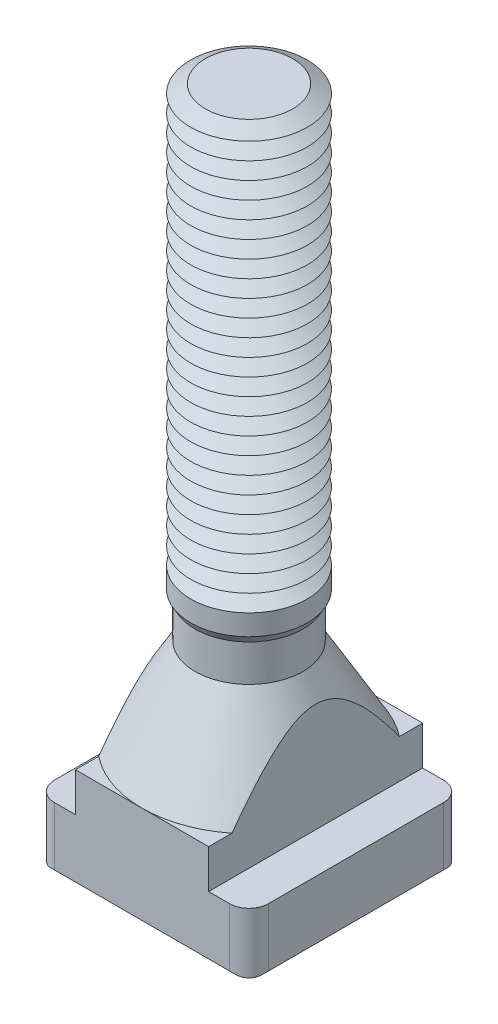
ISO-10303-21;
HEADER;
FILE_DESCRIPTION(('STEP AP214'),'2;1');
FILE_NAME('part.step','',(''),(''),'','','');
FILE_SCHEMA(('AUTOMOTIVE_DESIGN { 1 0 10303 214 1 1 1 1 }'));
ENDSEC;
DATA;
#1=APPLICATION_CONTEXT('core data for automotive mechanical design processes');
#2=APPLICATION_PROTOCOL_DEFINITION('international standard','automotive_design',2000,#1);
#3=PRODUCT_CONTEXT('',#1,'mechanical');
#4=PRODUCT('Part','Part','',(#3));
#5=PRODUCT_RELATED_PRODUCT_CATEGORY('part','',(#4));
#6=PRODUCT_DEFINITION_FORMATION('','',#4);
#7=PRODUCT_DEFINITION_CONTEXT('part definition',#1,'design');
#8=PRODUCT_DEFINITION('design','',#6,#7);
#9=PRODUCT_DEFINITION_SHAPE('','',#8);
#10=(LENGTH_UNIT() NAMED_UNIT(*) SI_UNIT(.MILLI.,.METRE.));
#11=(NAMED_UNIT(*) PLANE_ANGLE_UNIT() SI_UNIT($,.RADIAN.));
#12=(NAMED_UNIT(*) SI_UNIT($,.STERADIAN.) SOLID_ANGLE_UNIT());
#13=UNCERTAINTY_MEASURE_WITH_UNIT(LENGTH_MEASURE(1.E-05),#10,'distance_accuracy_value','');
#14=(GEOMETRIC_REPRESENTATION_CONTEXT(3) GLOBAL_UNCERTAINTY_ASSIGNED_CONTEXT((#13)) GLOBAL_UNIT_ASSIGNED_CONTEXT((#10,
#11,#12)) REPRESENTATION_CONTEXT('',''));
#15=CARTESIAN_POINT('',(0.,0.,0.));
#16=DIRECTION('',(0.,0.,1.));
#17=DIRECTION('',(1.,0.,0.));
#18=AXIS2_PLACEMENT_3D('',#15,#16,#17);
#19=CARTESIAN_POINT('',(0.,64.,0.));
#20=DIRECTION('',(0.,-1.,0.));
#21=DIRECTION('',(0.,0.,-1.));
#22=AXIS2_PLACEMENT_3D('',#19,#20,#21);
#23=CONICAL_SURFACE('',#22,4.48445554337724,1.0471975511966);
#24=CARTESIAN_POINT('',(0.,63.125,0.));
#25=DIRECTION('',(0.,-1.,0.));
#26=DIRECTION('',(0.,0.,-1.));
#27=AXIS2_PLACEMENT_3D('',#24,#25,#26);
#28=CIRCLE('',#27,6.00000000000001);
#29=CARTESIAN_POINT('',(0.,63.125,-6.00000000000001));
#30=VERTEX_POINT('',#29);
#31=EDGE_CURVE('E717',#30,#30,#28,.T.);
#32=ORIENTED_EDGE('',*,*,#31,.F.);
#33=EDGE_LOOP('',(#32));
#34=FACE_BOUND('',#33,.T.);
#35=CARTESIAN_POINT('',(0.,64.,0.));
#36=DIRECTION('',(0.,-1.,0.));
#37=DIRECTION('',(0.,0.,-1.));
#38=AXIS2_PLACEMENT_3D('',#35,#36,#37);
#39=CIRCLE('',#38,4.48445554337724);
#40=CARTESIAN_POINT('',(0.,64.,-4.48445554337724));
#41=VERTEX_POINT('',#40);
#42=EDGE_CURVE('E734',#41,#41,#39,.T.);
#43=ORIENTED_EDGE('',*,*,#42,.T.);
#44=EDGE_LOOP('',(#43));
#45=FACE_BOUND('',#44,.T.);
#46=ADVANCED_FACE('F39',(#34,#45),#23,.T.);
#47=CARTESIAN_POINT('',(0.,64.875,0.));
#48=DIRECTION('',(0.,1.,0.));
#49=DIRECTION('',(0.,0.,1.));
#50=AXIS2_PLACEMENT_3D('',#47,#48,#49);
#51=CONICAL_SURFACE('',#50,6.00000000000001,1.0471975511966);
#52=ORIENTED_EDGE('',*,*,#42,.F.);
#53=EDGE_LOOP('',(#52));
#54=FACE_BOUND('',#53,.T.);
#55=CARTESIAN_POINT('',(0.,64.875,0.));
#56=DIRECTION('',(0.,-1.,0.));
#57=DIRECTION('',(0.,0.,-1.));
#58=AXIS2_PLACEMENT_3D('',#55,#56,#57);
#59=CIRCLE('',#58,6.00000000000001);
#60=CARTESIAN_POINT('',(0.,64.875,-6.00000000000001));
#61=VERTEX_POINT('',#60);
#62=EDGE_CURVE('E731',#61,#61,#59,.T.);
#63=ORIENTED_EDGE('',*,*,#62,.T.);
#64=EDGE_LOOP('',(#63));
#65=FACE_BOUND('',#64,.T.);
#66=ADVANCED_FACE('F449',(#54,#65),#51,.T.);
#67=CARTESIAN_POINT('',(2.99882925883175,71.,0.));
#68=DIRECTION('',(0.,-1.,0.));
#69=DIRECTION('',(1.,0.,0.));
#70=AXIS2_PLACEMENT_3D('',#67,#68,#69);
#71=PLANE('',#70);
#72=CARTESIAN_POINT('',(0.,71.,0.));
#73=DIRECTION('',(0.,-1.,0.));
#74=DIRECTION('',(0.,0.,-1.));
#75=AXIS2_PLACEMENT_3D('',#72,#73,#74);
#76=CIRCLE('',#75,4.48445554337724);
#77=CARTESIAN_POINT('',(0.,71.,-4.48445554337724));
#78=VERTEX_POINT('',#77);
#79=EDGE_CURVE('E676',#78,#78,#76,.T.);
#80=ORIENTED_EDGE('',*,*,#79,.F.);
#81=EDGE_LOOP('',(#80));
#82=FACE_BOUND('',#81,.T.);
#83=ADVANCED_FACE('F455',(#82),#71,.F.);
#84=CARTESIAN_POINT('',(0.,71.,0.));
#85=DIRECTION('',(0.,-1.,0.));
#86=DIRECTION('',(0.,0.,-1.));
#87=AXIS2_PLACEMENT_3D('',#84,#85,#86);
#88=CONICAL_SURFACE('',#87,4.48445554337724,1.0471975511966);
#89=CARTESIAN_POINT('',(0.,70.125,0.));
#90=DIRECTION('',(0.,-1.,0.));
#91=DIRECTION('',(0.,0.,-1.));
#92=AXIS2_PLACEMENT_3D('',#89,#90,#91);
#93=CIRCLE('',#92,6.00000000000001);
#94=CARTESIAN_POINT('',(0.,70.125,-6.00000000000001));
#95=VERTEX_POINT('',#94);
#96=EDGE_CURVE('E680',#95,#95,#93,.T.);
#97=ORIENTED_EDGE('',*,*,#96,.F.);
#98=EDGE_LOOP('',(#97));
#99=FACE_BOUND('',#98,.T.);
#100=ORIENTED_EDGE('',*,*,#79,.T.);
#101=EDGE_LOOP('',(#100));
#102=FACE_BOUND('',#101,.T.);
#103=ADVANCED_FACE('F483',(#99,#102),#88,.T.);
#104=CARTESIAN_POINT('',(0.,70.125,0.));
#105=DIRECTION('',(0.,1.,0.));
#106=DIRECTION('',(0.,0.,1.));
#107=AXIS2_PLACEMENT_3D('',#104,#105,#106);
#108=CONICAL_SURFACE('',#107,6.00000000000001,1.0471975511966);
#109=CARTESIAN_POINT('',(0.,69.25,0.));
#110=DIRECTION('',(0.,-1.,0.));
#111=DIRECTION('',(0.,0.,-1.));
#112=AXIS2_PLACEMENT_3D('',#109,#110,#111);
#113=CIRCLE('',#112,4.48445554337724);
#114=CARTESIAN_POINT('',(0.,69.25,-4.48445554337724));
#115=VERTEX_POINT('',#114);
#116=EDGE_CURVE('E673',#115,#115,#113,.T.);
#117=ORIENTED_EDGE('',*,*,#116,.F.);
#118=EDGE_LOOP('',(#117));
#119=FACE_BOUND('',#118,.T.);
#120=ORIENTED_EDGE('',*,*,#96,.T.);
#121=EDGE_LOOP('',(#120));
#122=FACE_BOUND('',#121,.T.);
#123=ADVANCED_FACE('F480',(#119,#122),#108,.T.);
#124=CARTESIAN_POINT('',(0.,69.25,0.));
#125=DIRECTION('',(0.,-1.,0.));
#126=DIRECTION('',(0.,0.,-1.));
#127=AXIS2_PLACEMENT_3D('',#124,#125,#126);
#128=CONICAL_SURFACE('',#127,4.48445554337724,1.0471975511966);
#129=CARTESIAN_POINT('',(0.,68.375,0.));
#130=DIRECTION('',(0.,-1.,0.));
#131=DIRECTION('',(0.,0.,-1.));
#132=AXIS2_PLACEMENT_3D('',#129,#130,#131);
#133=CIRCLE('',#132,6.00000000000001);
#134=CARTESIAN_POINT('',(0.,68.375,-6.00000000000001));
#135=VERTEX_POINT('',#134);
#136=EDGE_CURVE('E670',#135,#135,#133,.T.);
#137=ORIENTED_EDGE('',*,*,#136,.F.);
#138=EDGE_LOOP('',(#137));
#139=FACE_BOUND('',#138,.T.);
#140=ORIENTED_EDGE('',*,*,#116,.T.);
#141=EDGE_LOOP('',(#140));
#142=FACE_BOUND('',#141,.T.);
#143=ADVANCED_FACE('F475',(#139,#142),#128,.T.);
#144=CARTESIAN_POINT('',(0.,68.375,0.));
#145=DIRECTION('',(0.,1.,0.));
#146=DIRECTION('',(0.,0.,1.));
#147=AXIS2_PLACEMENT_3D('',#144,#145,#146);
#148=CONICAL_SURFACE('',#147,6.00000000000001,1.0471975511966);
#149=CARTESIAN_POINT('',(0.,67.5,0.));
#150=DIRECTION('',(0.,-1.,0.));
#151=DIRECTION('',(0.,0.,-1.));
#152=AXIS2_PLACEMENT_3D('',#149,#150,#151);
#153=CIRCLE('',#152,4.48445554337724);
#154=CARTESIAN_POINT('',(0.,67.5,-4.48445554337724));
#155=VERTEX_POINT('',#154);
#156=EDGE_CURVE('E674',#155,#155,#153,.T.);
#157=ORIENTED_EDGE('',*,*,#156,.F.);
#158=EDGE_LOOP('',(#157));
#159=FACE_BOUND('',#158,.T.);
#160=ORIENTED_EDGE('',*,*,#136,.T.);
#161=EDGE_LOOP('',(#160));
#162=FACE_BOUND('',#161,.T.);
#163=ADVANCED_FACE('F472',(#159,#162),#148,.T.);
#164=CARTESIAN_POINT('',(0.,67.5,0.));
#165=DIRECTION('',(0.,-1.,0.));
#166=DIRECTION('',(0.,0.,-1.));
#167=AXIS2_PLACEMENT_3D('',#164,#165,#166);
#168=CONICAL_SURFACE('',#167,4.48445554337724,1.0471975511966);
#169=CARTESIAN_POINT('',(0.,66.625,0.));
#170=DIRECTION('',(0.,-1.,0.));
#171=DIRECTION('',(0.,0.,-1.));
#172=AXIS2_PLACEMENT_3D('',#169,#170,#171);
#173=CIRCLE('',#172,6.00000000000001);
#174=CARTESIAN_POINT('',(0.,66.625,-6.00000000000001));
#175=VERTEX_POINT('',#174);
#176=EDGE_CURVE('E745',#175,#175,#173,.T.);
#177=ORIENTED_EDGE('',*,*,#176,.F.);
#178=EDGE_LOOP('',(#177));
#179=FACE_BOUND('',#178,.T.);
#180=ORIENTED_EDGE('',*,*,#156,.T.);
#181=EDGE_LOOP('',(#180));
#182=FACE_BOUND('',#181,.T.);
#183=ADVANCED_FACE('F466',(#179,#182),#168,.T.);
#184=CARTESIAN_POINT('',(0.,66.625,0.));
#185=DIRECTION('',(0.,1.,0.));
#186=DIRECTION('',(0.,0.,1.));
#187=AXIS2_PLACEMENT_3D('',#184,#185,#186);
#188=CONICAL_SURFACE('',#187,6.00000000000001,1.0471975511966);
#189=CARTESIAN_POINT('',(0.,65.75,0.));
#190=DIRECTION('',(0.,-1.,0.));
#191=DIRECTION('',(0.,0.,-1.));
#192=AXIS2_PLACEMENT_3D('',#189,#190,#191);
#193=CIRCLE('',#192,4.48445554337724);
#194=CARTESIAN_POINT('',(0.,65.75,-4.48445554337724));
#195=VERTEX_POINT('',#194);
#196=EDGE_CURVE('E733',#195,#195,#193,.T.);
#197=ORIENTED_EDGE('',*,*,#196,.F.);
#198=EDGE_LOOP('',(#197));
#199=FACE_BOUND('',#198,.T.);
#200=ORIENTED_EDGE('',*,*,#176,.T.);
#201=EDGE_LOOP('',(#200));
#202=FACE_BOUND('',#201,.T.);
#203=ADVANCED_FACE('F462',(#199,#202),#188,.T.);
#204=CARTESIAN_POINT('',(0.,65.75,0.));
#205=DIRECTION('',(0.,-1.,0.));
#206=DIRECTION('',(0.,0.,-1.));
#207=AXIS2_PLACEMENT_3D('',#204,#205,#206);
#208=CONICAL_SURFACE('',#207,4.48445554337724,1.0471975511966);
#209=ORIENTED_EDGE('',*,*,#62,.F.);
#210=EDGE_LOOP('',(#209));
#211=FACE_BOUND('',#210,.T.);
#212=ORIENTED_EDGE('',*,*,#196,.T.);
#213=EDGE_LOOP('',(#212));
#214=FACE_BOUND('',#213,.T.);
#215=ADVANCED_FACE('F465',(#211,#214),#208,.T.);
#216=CARTESIAN_POINT('',(0.,62.25,0.));
#217=DIRECTION('',(0.,-1.,0.));
#218=DIRECTION('',(0.,0.,-1.));
#219=AXIS2_PLACEMENT_3D('',#216,#217,#218);
#220=CONICAL_SURFACE('',#219,4.48445554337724,1.0471975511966);
#221=CARTESIAN_POINT('',(0.,61.375,0.));
#222=DIRECTION('',(0.,-1.,0.));
#223=DIRECTION('',(0.,0.,-1.));
#224=AXIS2_PLACEMENT_3D('',#221,#222,#223);
#225=CIRCLE('',#224,6.00000000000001);
#226=CARTESIAN_POINT('',(0.,61.375,-6.00000000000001));
#227=VERTEX_POINT('',#226);
#228=EDGE_CURVE('E718',#227,#227,#225,.T.);
#229=ORIENTED_EDGE('',*,*,#228,.F.);
#230=EDGE_LOOP('',(#229));
#231=FACE_BOUND('',#230,.T.);
#232=CARTESIAN_POINT('',(0.,62.25,0.));
#233=DIRECTION('',(0.,-1.,0.));
#234=DIRECTION('',(0.,0.,-1.));
#235=AXIS2_PLACEMENT_3D('',#232,#233,#234);
#236=CIRCLE('',#235,4.48445554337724);
#237=CARTESIAN_POINT('',(0.,62.25,-4.48445554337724));
#238=VERTEX_POINT('',#237);
#239=EDGE_CURVE('E715',#238,#238,#236,.T.);
#240=ORIENTED_EDGE('',*,*,#239,.T.);
#241=EDGE_LOOP('',(#240));
#242=FACE_BOUND('',#241,.T.);
#243=ADVANCED_FACE('F470',(#231,#242),#220,.T.);
#244=CARTESIAN_POINT('',(0.,63.125,0.));
#245=DIRECTION('',(0.,1.,0.));
#246=DIRECTION('',(0.,0.,1.));
#247=AXIS2_PLACEMENT_3D('',#244,#245,#246);
#248=CONICAL_SURFACE('',#247,6.00000000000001,1.0471975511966);
#249=ORIENTED_EDGE('',*,*,#239,.F.);
#250=EDGE_LOOP('',(#249));
#251=FACE_BOUND('',#250,.T.);
#252=ORIENTED_EDGE('',*,*,#31,.T.);
#253=EDGE_LOOP('',(#252));
#254=FACE_BOUND('',#253,.T.);
#255=ADVANCED_FACE('F879',(#251,#254),#248,.T.);
#256=CARTESIAN_POINT('',(0.,60.5,0.));
#257=DIRECTION('',(0.,-1.,0.));
#258=DIRECTION('',(0.,0.,-1.));
#259=AXIS2_PLACEMENT_3D('',#256,#257,#258);
#260=CONICAL_SURFACE('',#259,4.48445554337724,1.0471975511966);
#261=CARTESIAN_POINT('',(0.,59.625,0.));
#262=DIRECTION('',(0.,-1.,0.));
#263=DIRECTION('',(0.,0.,-1.));
#264=AXIS2_PLACEMENT_3D('',#261,#262,#263);
#265=CIRCLE('',#264,6.00000000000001);
#266=CARTESIAN_POINT('',(0.,59.625,-6.00000000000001));
#267=VERTEX_POINT('',#266);
#268=EDGE_CURVE('E698',#267,#267,#265,.T.);
#269=ORIENTED_EDGE('',*,*,#268,.F.);
#270=EDGE_LOOP('',(#269));
#271=FACE_BOUND('',#270,.T.);
#272=CARTESIAN_POINT('',(0.,60.5,0.));
#273=DIRECTION('',(0.,-1.,0.));
#274=DIRECTION('',(0.,0.,-1.));
#275=AXIS2_PLACEMENT_3D('',#272,#273,#274);
#276=CIRCLE('',#275,4.48445554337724);
#277=CARTESIAN_POINT('',(0.,60.5,-4.48445554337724));
#278=VERTEX_POINT('',#277);
#279=EDGE_CURVE('E858',#278,#278,#276,.T.);
#280=ORIENTED_EDGE('',*,*,#279,.T.);
#281=EDGE_LOOP('',(#280));
#282=FACE_BOUND('',#281,.T.);
#283=ADVANCED_FACE('F884',(#271,#282),#260,.T.);
#284=CARTESIAN_POINT('',(0.,61.375,0.));
#285=DIRECTION('',(0.,1.,0.));
#286=DIRECTION('',(0.,0.,1.));
#287=AXIS2_PLACEMENT_3D('',#284,#285,#286);
#288=CONICAL_SURFACE('',#287,6.00000000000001,1.0471975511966);
#289=ORIENTED_EDGE('',*,*,#279,.F.);
#290=EDGE_LOOP('',(#289));
#291=FACE_BOUND('',#290,.T.);
#292=ORIENTED_EDGE('',*,*,#228,.T.);
#293=EDGE_LOOP('',(#292));
#294=FACE_BOUND('',#293,.T.);
#295=ADVANCED_FACE('F875',(#291,#294),#288,.T.);
#296=CARTESIAN_POINT('',(0.,58.75,0.));
#297=DIRECTION('',(0.,-1.,0.));
#298=DIRECTION('',(0.,0.,-1.));
#299=AXIS2_PLACEMENT_3D('',#296,#297,#298);
#300=CONICAL_SURFACE('',#299,4.48445554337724,1.0471975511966);
#301=CARTESIAN_POINT('',(0.,57.875,0.));
#302=DIRECTION('',(0.,-1.,0.));
#303=DIRECTION('',(0.,0.,-1.));
#304=AXIS2_PLACEMENT_3D('',#301,#302,#303);
#305=CIRCLE('',#304,6.00000000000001);
#306=CARTESIAN_POINT('',(0.,57.875,-6.00000000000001));
#307=VERTEX_POINT('',#306);
#308=EDGE_CURVE('E699',#307,#307,#305,.T.);
#309=ORIENTED_EDGE('',*,*,#308,.F.);
#310=EDGE_LOOP('',(#309));
#311=FACE_BOUND('',#310,.T.);
#312=CARTESIAN_POINT('',(0.,58.75,0.));
#313=DIRECTION('',(0.,-1.,0.));
#314=DIRECTION('',(0.,0.,-1.));
#315=AXIS2_PLACEMENT_3D('',#312,#313,#314);
#316=CIRCLE('',#315,4.48445554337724);
#317=CARTESIAN_POINT('',(0.,58.75,-4.48445554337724));
#318=VERTEX_POINT('',#317);
#319=EDGE_CURVE('E695',#318,#318,#316,.T.);
#320=ORIENTED_EDGE('',*,*,#319,.T.);
#321=EDGE_LOOP('',(#320));
#322=FACE_BOUND('',#321,.T.);
#323=ADVANCED_FACE('F894',(#311,#322),#300,.T.);
#324=CARTESIAN_POINT('',(0.,59.625,0.));
#325=DIRECTION('',(0.,1.,0.));
#326=DIRECTION('',(0.,0.,1.));
#327=AXIS2_PLACEMENT_3D('',#324,#325,#326);
#328=CONICAL_SURFACE('',#327,6.00000000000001,1.0471975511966);
#329=ORIENTED_EDGE('',*,*,#319,.F.);
#330=EDGE_LOOP('',(#329));
#331=FACE_BOUND('',#330,.T.);
#332=ORIENTED_EDGE('',*,*,#268,.T.);
#333=EDGE_LOOP('',(#332));
#334=FACE_BOUND('',#333,.T.);
#335=ADVANCED_FACE('F898',(#331,#334),#328,.T.);
#336=CARTESIAN_POINT('',(0.,57.,0.));
#337=DIRECTION('',(0.,-1.,0.));
#338=DIRECTION('',(0.,0.,-1.));
#339=AXIS2_PLACEMENT_3D('',#336,#337,#338);
#340=CONICAL_SURFACE('',#339,4.48445554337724,1.0471975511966);
#341=CARTESIAN_POINT('',(0.,56.125,0.));
#342=DIRECTION('',(0.,-1.,0.));
#343=DIRECTION('',(0.,0.,-1.));
#344=AXIS2_PLACEMENT_3D('',#341,#342,#343);
#345=CIRCLE('',#344,6.00000000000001);
#346=CARTESIAN_POINT('',(0.,56.125,-6.00000000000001));
#347=VERTEX_POINT('',#346);
#348=EDGE_CURVE('E693',#347,#347,#345,.T.);
#349=ORIENTED_EDGE('',*,*,#348,.F.);
#350=EDGE_LOOP('',(#349));
#351=FACE_BOUND('',#350,.T.);
#352=CARTESIAN_POINT('',(0.,57.,0.));
#353=DIRECTION('',(0.,-1.,0.));
#354=DIRECTION('',(0.,0.,-1.));
#355=AXIS2_PLACEMENT_3D('',#352,#353,#354);
#356=CIRCLE('',#355,4.48445554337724);
#357=CARTESIAN_POINT('',(0.,57.,-4.48445554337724));
#358=VERTEX_POINT('',#357);
#359=EDGE_CURVE('E781',#358,#358,#356,.T.);
#360=ORIENTED_EDGE('',*,*,#359,.T.);
#361=EDGE_LOOP('',(#360));
#362=FACE_BOUND('',#361,.T.);
#363=ADVANCED_FACE('F902',(#351,#362),#340,.T.);
#364=CARTESIAN_POINT('',(0.,57.875,0.));
#365=DIRECTION('',(0.,1.,0.));
#366=DIRECTION('',(0.,0.,1.));
#367=AXIS2_PLACEMENT_3D('',#364,#365,#366);
#368=CONICAL_SURFACE('',#367,6.00000000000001,1.0471975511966);
#369=ORIENTED_EDGE('',*,*,#359,.F.);
#370=EDGE_LOOP('',(#369));
#371=FACE_BOUND('',#370,.T.);
#372=ORIENTED_EDGE('',*,*,#308,.T.);
#373=EDGE_LOOP('',(#372));
#374=FACE_BOUND('',#373,.T.);
#375=ADVANCED_FACE('F906',(#371,#374),#368,.T.);
#376=CARTESIAN_POINT('',(0.,55.25,0.));
#377=DIRECTION('',(0.,-1.,0.));
#378=DIRECTION('',(0.,0.,-1.));
#379=AXIS2_PLACEMENT_3D('',#376,#377,#378);
#380=CONICAL_SURFACE('',#379,4.48445554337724,1.0471975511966);
#381=CARTESIAN_POINT('',(0.,54.375,0.));
#382=DIRECTION('',(0.,-1.,0.));
#383=DIRECTION('',(0.,0.,-1.));
#384=AXIS2_PLACEMENT_3D('',#381,#382,#383);
#385=CIRCLE('',#384,6.00000000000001);
#386=CARTESIAN_POINT('',(0.,54.375,-6.00000000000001));
#387=VERTEX_POINT('',#386);
#388=EDGE_CURVE('E649',#387,#387,#385,.T.);
#389=ORIENTED_EDGE('',*,*,#388,.F.);
#390=EDGE_LOOP('',(#389));
#391=FACE_BOUND('',#390,.T.);
#392=CARTESIAN_POINT('',(0.,55.25,0.));
#393=DIRECTION('',(0.,-1.,0.));
#394=DIRECTION('',(0.,0.,-1.));
#395=AXIS2_PLACEMENT_3D('',#392,#393,#394);
#396=CIRCLE('',#395,4.48445554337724);
#397=CARTESIAN_POINT('',(0.,55.25,-4.48445554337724));
#398=VERTEX_POINT('',#397);
#399=EDGE_CURVE('E690',#398,#398,#396,.T.);
#400=ORIENTED_EDGE('',*,*,#399,.T.);
#401=EDGE_LOOP('',(#400));
#402=FACE_BOUND('',#401,.T.);
#403=ADVANCED_FACE('F910',(#391,#402),#380,.T.);
#404=CARTESIAN_POINT('',(0.,56.125,0.));
#405=DIRECTION('',(0.,1.,0.));
#406=DIRECTION('',(0.,0.,1.));
#407=AXIS2_PLACEMENT_3D('',#404,#405,#406);
#408=CONICAL_SURFACE('',#407,6.00000000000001,1.0471975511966);
#409=ORIENTED_EDGE('',*,*,#399,.F.);
#410=EDGE_LOOP('',(#409));
#411=FACE_BOUND('',#410,.T.);
#412=ORIENTED_EDGE('',*,*,#348,.T.);
#413=EDGE_LOOP('',(#412));
#414=FACE_BOUND('',#413,.T.);
#415=ADVANCED_FACE('F914',(#411,#414),#408,.T.);
#416=CARTESIAN_POINT('',(0.,53.5,0.));
#417=DIRECTION('',(0.,-1.,0.));
#418=DIRECTION('',(0.,0.,-1.));
#419=AXIS2_PLACEMENT_3D('',#416,#417,#418);
#420=CONICAL_SURFACE('',#419,4.48445554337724,1.0471975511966);
#421=CARTESIAN_POINT('',(0.,52.625,0.));
#422=DIRECTION('',(0.,-1.,0.));
#423=DIRECTION('',(0.,0.,-1.));
#424=AXIS2_PLACEMENT_3D('',#421,#422,#423);
#425=CIRCLE('',#424,6.00000000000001);
#426=CARTESIAN_POINT('',(0.,52.625,-6.00000000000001));
#427=VERTEX_POINT('',#426);
#428=EDGE_CURVE('E650',#427,#427,#425,.T.);
#429=ORIENTED_EDGE('',*,*,#428,.F.);
#430=EDGE_LOOP('',(#429));
#431=FACE_BOUND('',#430,.T.);
#432=CARTESIAN_POINT('',(0.,53.5,0.));
#433=DIRECTION('',(0.,-1.,0.));
#434=DIRECTION('',(0.,0.,-1.));
#435=AXIS2_PLACEMENT_3D('',#432,#433,#434);
#436=CIRCLE('',#435,4.48445554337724);
#437=CARTESIAN_POINT('',(0.,53.5,-4.48445554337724));
#438=VERTEX_POINT('',#437);
#439=EDGE_CURVE('E646',#438,#438,#436,.T.);
#440=ORIENTED_EDGE('',*,*,#439,.T.);
#441=EDGE_LOOP('',(#440));
#442=FACE_BOUND('',#441,.T.);
#443=ADVANCED_FACE('F918',(#431,#442),#420,.T.);
#444=CARTESIAN_POINT('',(0.,54.375,0.));
#445=DIRECTION('',(0.,1.,0.));
#446=DIRECTION('',(0.,0.,1.));
#447=AXIS2_PLACEMENT_3D('',#444,#445,#446);
#448=CONICAL_SURFACE('',#447,6.00000000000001,1.0471975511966);
#449=ORIENTED_EDGE('',*,*,#439,.F.);
#450=EDGE_LOOP('',(#449));
#451=FACE_BOUND('',#450,.T.);
#452=ORIENTED_EDGE('',*,*,#388,.T.);
#453=EDGE_LOOP('',(#452));
#454=FACE_BOUND('',#453,.T.);
#455=ADVANCED_FACE('F922',(#451,#454),#448,.T.);
#456=CARTESIAN_POINT('',(0.,51.75,0.));
#457=DIRECTION('',(0.,-1.,0.));
#458=DIRECTION('',(0.,0.,-1.));
#459=AXIS2_PLACEMENT_3D('',#456,#457,#458);
#460=CONICAL_SURFACE('',#459,4.48445554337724,1.0471975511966);
#461=CARTESIAN_POINT('',(0.,50.875,0.));
#462=DIRECTION('',(0.,-1.,0.));
#463=DIRECTION('',(0.,0.,-1.));
#464=AXIS2_PLACEMENT_3D('',#461,#462,#463);
#465=CIRCLE('',#464,6.00000000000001);
#466=CARTESIAN_POINT('',(0.,50.875,-6.00000000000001));
#467=VERTEX_POINT('',#466);
#468=EDGE_CURVE('E725',#467,#467,#465,.T.);
#469=ORIENTED_EDGE('',*,*,#468,.F.);
#470=EDGE_LOOP('',(#469));
#471=FACE_BOUND('',#470,.T.);
#472=CARTESIAN_POINT('',(0.,51.75,0.));
#473=DIRECTION('',(0.,-1.,0.));
#474=DIRECTION('',(0.,0.,-1.));
#475=AXIS2_PLACEMENT_3D('',#472,#473,#474);
#476=CIRCLE('',#475,4.48445554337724);
#477=CARTESIAN_POINT('',(0.,51.75,-4.48445554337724));
#478=VERTEX_POINT('',#477);
#479=EDGE_CURVE('E728',#478,#478,#476,.T.);
#480=ORIENTED_EDGE('',*,*,#479,.T.);
#481=EDGE_LOOP('',(#480));
#482=FACE_BOUND('',#481,.T.);
#483=ADVANCED_FACE('F926',(#471,#482),#460,.T.);
#484=CARTESIAN_POINT('',(0.,52.625,0.));
#485=DIRECTION('',(0.,1.,0.));
#486=DIRECTION('',(0.,0.,1.));
#487=AXIS2_PLACEMENT_3D('',#484,#485,#486);
#488=CONICAL_SURFACE('',#487,6.00000000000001,1.0471975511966);
#489=ORIENTED_EDGE('',*,*,#479,.F.);
#490=EDGE_LOOP('',(#489));
#491=FACE_BOUND('',#490,.T.);
#492=ORIENTED_EDGE('',*,*,#428,.T.);
#493=EDGE_LOOP('',(#492));
#494=FACE_BOUND('',#493,.T.);
#495=ADVANCED_FACE('F930',(#491,#494),#488,.T.);
#496=CARTESIAN_POINT('',(0.,50.,0.));
#497=DIRECTION('',(0.,-1.,0.));
#498=DIRECTION('',(0.,0.,-1.));
#499=AXIS2_PLACEMENT_3D('',#496,#497,#498);
#500=CONICAL_SURFACE('',#499,4.48445554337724,1.0471975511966);
#501=CARTESIAN_POINT('',(0.,49.125,0.));
#502=DIRECTION('',(0.,-1.,0.));
#503=DIRECTION('',(0.,0.,-1.));
#504=AXIS2_PLACEMENT_3D('',#501,#502,#503);
#505=CIRCLE('',#504,6.00000000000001);
#506=CARTESIAN_POINT('',(0.,49.125,-6.00000000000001));
#507=VERTEX_POINT('',#506);
#508=EDGE_CURVE('E667',#507,#507,#505,.T.);
#509=ORIENTED_EDGE('',*,*,#508,.F.);
#510=EDGE_LOOP('',(#509));
#511=FACE_BOUND('',#510,.T.);
#512=CARTESIAN_POINT('',(0.,50.,0.));
#513=DIRECTION('',(0.,-1.,0.));
#514=DIRECTION('',(0.,0.,-1.));
#515=AXIS2_PLACEMENT_3D('',#512,#513,#514);
#516=CIRCLE('',#515,4.48445554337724);
#517=CARTESIAN_POINT('',(0.,50.,-4.48445554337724));
#518=VERTEX_POINT('',#517);
#519=EDGE_CURVE('E729',#518,#518,#516,.T.);
#520=ORIENTED_EDGE('',*,*,#519,.T.);
#521=EDGE_LOOP('',(#520));
#522=FACE_BOUND('',#521,.T.);
#523=ADVANCED_FACE('F934',(#511,#522),#500,.T.);
#524=CARTESIAN_POINT('',(0.,50.875,0.));
#525=DIRECTION('',(0.,1.,0.));
#526=DIRECTION('',(0.,0.,1.));
#527=AXIS2_PLACEMENT_3D('',#524,#525,#526);
#528=CONICAL_SURFACE('',#527,6.00000000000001,1.0471975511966);
#529=ORIENTED_EDGE('',*,*,#519,.F.);
#530=EDGE_LOOP('',(#529));
#531=FACE_BOUND('',#530,.T.);
#532=ORIENTED_EDGE('',*,*,#468,.T.);
#533=EDGE_LOOP('',(#532));
#534=FACE_BOUND('',#533,.T.);
#535=ADVANCED_FACE('F938',(#531,#534),#528,.T.);
#536=CARTESIAN_POINT('',(0.,48.25,0.));
#537=DIRECTION('',(0.,-1.,0.));
#538=DIRECTION('',(0.,0.,-1.));
#539=AXIS2_PLACEMENT_3D('',#536,#537,#538);
#540=CONICAL_SURFACE('',#539,4.48445554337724,1.0471975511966);
#541=CARTESIAN_POINT('',(0.,47.375,0.));
#542=DIRECTION('',(0.,-1.,0.));
#543=DIRECTION('',(0.,0.,-1.));
#544=AXIS2_PLACEMENT_3D('',#541,#542,#543);
#545=CIRCLE('',#544,6.00000000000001);
#546=CARTESIAN_POINT('',(0.,47.375,-6.00000000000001));
#547=VERTEX_POINT('',#546);
#548=EDGE_CURVE('E668',#547,#547,#545,.T.);
#549=ORIENTED_EDGE('',*,*,#548,.F.);
#550=EDGE_LOOP('',(#549));
#551=FACE_BOUND('',#550,.T.);
#552=CARTESIAN_POINT('',(0.,48.25,0.));
#553=DIRECTION('',(0.,-1.,0.));
#554=DIRECTION('',(0.,0.,-1.));
#555=AXIS2_PLACEMENT_3D('',#552,#553,#554);
#556=CIRCLE('',#555,4.48445554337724);
#557=CARTESIAN_POINT('',(0.,48.25,-4.48445554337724));
#558=VERTEX_POINT('',#557);
#559=EDGE_CURVE('E664',#558,#558,#556,.T.);
#560=ORIENTED_EDGE('',*,*,#559,.T.);
#561=EDGE_LOOP('',(#560));
#562=FACE_BOUND('',#561,.T.);
#563=ADVANCED_FACE('F942',(#551,#562),#540,.T.);
#564=CARTESIAN_POINT('',(0.,49.125,0.));
#565=DIRECTION('',(0.,1.,0.));
#566=DIRECTION('',(0.,0.,1.));
#567=AXIS2_PLACEMENT_3D('',#564,#565,#566);
#568=CONICAL_SURFACE('',#567,6.00000000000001,1.0471975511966);
#569=ORIENTED_EDGE('',*,*,#559,.F.);
#570=EDGE_LOOP('',(#569));
#571=FACE_BOUND('',#570,.T.);
#572=ORIENTED_EDGE('',*,*,#508,.T.);
#573=EDGE_LOOP('',(#572));
#574=FACE_BOUND('',#573,.T.);
#575=ADVANCED_FACE('F946',(#571,#574),#568,.T.);
#576=CARTESIAN_POINT('',(0.,46.5,0.));
#577=DIRECTION('',(0.,-1.,0.));
#578=DIRECTION('',(0.,0.,-1.));
#579=AXIS2_PLACEMENT_3D('',#576,#577,#578);
#580=CONICAL_SURFACE('',#579,4.48445554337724,1.0471975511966);
#581=CARTESIAN_POINT('',(0.,45.625,0.));
#582=DIRECTION('',(0.,-1.,0.));
#583=DIRECTION('',(0.,0.,-1.));
#584=AXIS2_PLACEMENT_3D('',#581,#582,#583);
#585=CIRCLE('',#584,6.00000000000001);
#586=CARTESIAN_POINT('',(0.,45.625,-6.00000000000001));
#587=VERTEX_POINT('',#586);
#588=EDGE_CURVE('E742',#587,#587,#585,.T.);
#589=ORIENTED_EDGE('',*,*,#588,.F.);
#590=EDGE_LOOP('',(#589));
#591=FACE_BOUND('',#590,.T.);
#592=CARTESIAN_POINT('',(0.,46.5,0.));
#593=DIRECTION('',(0.,-1.,0.));
#594=DIRECTION('',(0.,0.,-1.));
#595=AXIS2_PLACEMENT_3D('',#592,#593,#594);
#596=CIRCLE('',#595,4.48445554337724);
#597=CARTESIAN_POINT('',(0.,46.5,-4.48445554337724));
#598=VERTEX_POINT('',#597);
#599=EDGE_CURVE('E706',#598,#598,#596,.T.);
#600=ORIENTED_EDGE('',*,*,#599,.T.);
#601=EDGE_LOOP('',(#600));
#602=FACE_BOUND('',#601,.T.);
#603=ADVANCED_FACE('F950',(#591,#602),#580,.T.);
#604=CARTESIAN_POINT('',(0.,47.375,0.));
#605=DIRECTION('',(0.,1.,0.));
#606=DIRECTION('',(0.,0.,1.));
#607=AXIS2_PLACEMENT_3D('',#604,#605,#606);
#608=CONICAL_SURFACE('',#607,6.00000000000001,1.0471975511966);
#609=ORIENTED_EDGE('',*,*,#599,.F.);
#610=EDGE_LOOP('',(#609));
#611=FACE_BOUND('',#610,.T.);
#612=ORIENTED_EDGE('',*,*,#548,.T.);
#613=EDGE_LOOP('',(#612));
#614=FACE_BOUND('',#613,.T.);
#615=ADVANCED_FACE('F954',(#611,#614),#608,.T.);
#616=CARTESIAN_POINT('',(0.,44.75,0.));
#617=DIRECTION('',(0.,-1.,0.));
#618=DIRECTION('',(0.,0.,-1.));
#619=AXIS2_PLACEMENT_3D('',#616,#617,#618);
#620=CONICAL_SURFACE('',#619,4.48445554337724,1.0471975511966);
#621=CARTESIAN_POINT('',(0.,43.875,0.));
#622=DIRECTION('',(0.,-1.,0.));
#623=DIRECTION('',(0.,0.,-1.));
#624=AXIS2_PLACEMENT_3D('',#621,#622,#623);
#625=CIRCLE('',#624,6.00000000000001);
#626=CARTESIAN_POINT('',(0.,43.875,-6.00000000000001));
#627=VERTEX_POINT('',#626);
#628=EDGE_CURVE('E659',#627,#627,#625,.T.);
#629=ORIENTED_EDGE('',*,*,#628,.F.);
#630=EDGE_LOOP('',(#629));
#631=FACE_BOUND('',#630,.T.);
#632=CARTESIAN_POINT('',(0.,44.75,0.));
#633=DIRECTION('',(0.,-1.,0.));
#634=DIRECTION('',(0.,0.,-1.));
#635=AXIS2_PLACEMENT_3D('',#632,#633,#634);
#636=CIRCLE('',#635,4.48445554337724);
#637=CARTESIAN_POINT('',(0.,44.75,-4.48445554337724));
#638=VERTEX_POINT('',#637);
#639=EDGE_CURVE('E662',#638,#638,#636,.T.);
#640=ORIENTED_EDGE('',*,*,#639,.T.);
#641=EDGE_LOOP('',(#640));
#642=FACE_BOUND('',#641,.T.);
#643=ADVANCED_FACE('F958',(#631,#642),#620,.T.);
#644=CARTESIAN_POINT('',(0.,45.625,0.));
#645=DIRECTION('',(0.,1.,0.));
#646=DIRECTION('',(0.,0.,1.));
#647=AXIS2_PLACEMENT_3D('',#644,#645,#646);
#648=CONICAL_SURFACE('',#647,6.00000000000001,1.0471975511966);
#649=ORIENTED_EDGE('',*,*,#639,.F.);
#650=EDGE_LOOP('',(#649));
#651=FACE_BOUND('',#650,.T.);
#652=ORIENTED_EDGE('',*,*,#588,.T.);
#653=EDGE_LOOP('',(#652));
#654=FACE_BOUND('',#653,.T.);
#655=ADVANCED_FACE('F962',(#651,#654),#648,.T.);
#656=CARTESIAN_POINT('',(0.,43.,0.));
#657=DIRECTION('',(0.,-1.,0.));
#658=DIRECTION('',(0.,0.,-1.));
#659=AXIS2_PLACEMENT_3D('',#656,#657,#658);
#660=CONICAL_SURFACE('',#659,4.48445554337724,1.0471975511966);
#661=CARTESIAN_POINT('',(0.,42.125,0.));
#662=DIRECTION('',(0.,-1.,0.));
#663=DIRECTION('',(0.,0.,-1.));
#664=AXIS2_PLACEMENT_3D('',#661,#662,#663);
#665=CIRCLE('',#664,6.00000000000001);
#666=CARTESIAN_POINT('',(0.,42.125,-6.00000000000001));
#667=VERTEX_POINT('',#666);
#668=EDGE_CURVE('E640',#667,#667,#665,.T.);
#669=ORIENTED_EDGE('',*,*,#668,.F.);
#670=EDGE_LOOP('',(#669));
#671=FACE_BOUND('',#670,.T.);
#672=CARTESIAN_POINT('',(0.,43.,0.));
#673=DIRECTION('',(0.,-1.,0.));
#674=DIRECTION('',(0.,0.,-1.));
#675=AXIS2_PLACEMENT_3D('',#672,#673,#674);
#676=CIRCLE('',#675,4.48445554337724);
#677=CARTESIAN_POINT('',(0.,43.,-4.48445554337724));
#678=VERTEX_POINT('',#677);
#679=EDGE_CURVE('E643',#678,#678,#676,.T.);
#680=ORIENTED_EDGE('',*,*,#679,.T.);
#681=EDGE_LOOP('',(#680));
#682=FACE_BOUND('',#681,.T.);
#683=ADVANCED_FACE('F966',(#671,#682),#660,.T.);
#684=CARTESIAN_POINT('',(0.,43.875,0.));
#685=DIRECTION('',(0.,1.,0.));
#686=DIRECTION('',(0.,0.,1.));
#687=AXIS2_PLACEMENT_3D('',#684,#685,#686);
#688=CONICAL_SURFACE('',#687,6.00000000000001,1.0471975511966);
#689=ORIENTED_EDGE('',*,*,#679,.F.);
#690=EDGE_LOOP('',(#689));
#691=FACE_BOUND('',#690,.T.);
#692=ORIENTED_EDGE('',*,*,#628,.T.);
#693=EDGE_LOOP('',(#692));
#694=FACE_BOUND('',#693,.T.);
#695=ADVANCED_FACE('F970',(#691,#694),#688,.T.);
#696=CARTESIAN_POINT('',(0.,41.25,0.));
#697=DIRECTION('',(0.,-1.,0.));
#698=DIRECTION('',(0.,0.,-1.));
#699=AXIS2_PLACEMENT_3D('',#696,#697,#698);
#700=CONICAL_SURFACE('',#699,4.48445554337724,1.0471975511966);
#701=CARTESIAN_POINT('',(0.,40.375,0.));
#702=DIRECTION('',(0.,-1.,0.));
#703=DIRECTION('',(0.,0.,-1.));
#704=AXIS2_PLACEMENT_3D('',#701,#702,#703);
#705=CIRCLE('',#704,6.00000000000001);
#706=CARTESIAN_POINT('',(0.,40.375,-6.00000000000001));
#707=VERTEX_POINT('',#706);
#708=EDGE_CURVE('E819',#707,#707,#705,.T.);
#709=ORIENTED_EDGE('',*,*,#708,.F.);
#710=EDGE_LOOP('',(#709));
#711=FACE_BOUND('',#710,.T.);
#712=CARTESIAN_POINT('',(0.,41.25,0.));
#713=DIRECTION('',(0.,-1.,0.));
#714=DIRECTION('',(0.,0.,-1.));
#715=AXIS2_PLACEMENT_3D('',#712,#713,#714);
#716=CIRCLE('',#715,4.48445554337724);
#717=CARTESIAN_POINT('',(0.,41.25,-4.48445554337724));
#718=VERTEX_POINT('',#717);
#719=EDGE_CURVE('E644',#718,#718,#716,.T.);
#720=ORIENTED_EDGE('',*,*,#719,.T.);
#721=EDGE_LOOP('',(#720));
#722=FACE_BOUND('',#721,.T.);
#723=ADVANCED_FACE('F974',(#711,#722),#700,.T.);
#724=CARTESIAN_POINT('',(0.,42.125,0.));
#725=DIRECTION('',(0.,1.,0.));
#726=DIRECTION('',(0.,0.,1.));
#727=AXIS2_PLACEMENT_3D('',#724,#725,#726);
#728=CONICAL_SURFACE('',#727,6.00000000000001,1.0471975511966);
#729=ORIENTED_EDGE('',*,*,#719,.F.);
#730=EDGE_LOOP('',(#729));
#731=FACE_BOUND('',#730,.T.);
#732=ORIENTED_EDGE('',*,*,#668,.T.);
#733=EDGE_LOOP('',(#732));
#734=FACE_BOUND('',#733,.T.);
#735=ADVANCED_FACE('F978',(#731,#734),#728,.T.);
#736=CARTESIAN_POINT('',(0.,39.5,0.));
#737=DIRECTION('',(0.,-1.,0.));
#738=DIRECTION('',(0.,0.,-1.));
#739=AXIS2_PLACEMENT_3D('',#736,#737,#738);
#740=CONICAL_SURFACE('',#739,4.48445554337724,1.0471975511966);
#741=CARTESIAN_POINT('',(0.,38.625,0.));
#742=DIRECTION('',(0.,-1.,0.));
#743=DIRECTION('',(0.,0.,-1.));
#744=AXIS2_PLACEMENT_3D('',#741,#742,#743);
#745=CIRCLE('',#744,6.00000000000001);
#746=CARTESIAN_POINT('',(0.,38.625,-6.00000000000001));
#747=VERTEX_POINT('',#746);
#748=EDGE_CURVE('E709',#747,#747,#745,.T.);
#749=ORIENTED_EDGE('',*,*,#748,.F.);
#750=EDGE_LOOP('',(#749));
#751=FACE_BOUND('',#750,.T.);
#752=CARTESIAN_POINT('',(0.,39.5,0.));
#753=DIRECTION('',(0.,-1.,0.));
#754=DIRECTION('',(0.,0.,-1.));
#755=AXIS2_PLACEMENT_3D('',#752,#753,#754);
#756=CIRCLE('',#755,4.48445554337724);
#757=CARTESIAN_POINT('',(0.,39.5,-4.48445554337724));
#758=VERTEX_POINT('',#757);
#759=EDGE_CURVE('E712',#758,#758,#756,.T.);
#760=ORIENTED_EDGE('',*,*,#759,.T.);
#761=EDGE_LOOP('',(#760));
#762=FACE_BOUND('',#761,.T.);
#763=ADVANCED_FACE('F982',(#751,#762),#740,.T.);
#764=CARTESIAN_POINT('',(0.,40.375,0.));
#765=DIRECTION('',(0.,1.,0.));
#766=DIRECTION('',(0.,0.,1.));
#767=AXIS2_PLACEMENT_3D('',#764,#765,#766);
#768=CONICAL_SURFACE('',#767,6.00000000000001,1.0471975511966);
#769=ORIENTED_EDGE('',*,*,#759,.F.);
#770=EDGE_LOOP('',(#769));
#771=FACE_BOUND('',#770,.T.);
#772=ORIENTED_EDGE('',*,*,#708,.T.);
#773=EDGE_LOOP('',(#772));
#774=FACE_BOUND('',#773,.T.);
#775=ADVANCED_FACE('F986',(#771,#774),#768,.T.);
#776=CARTESIAN_POINT('',(0.,37.75,0.));
#777=DIRECTION('',(0.,-1.,0.));
#778=DIRECTION('',(0.,0.,-1.));
#779=AXIS2_PLACEMENT_3D('',#776,#777,#778);
#780=CONICAL_SURFACE('',#779,4.48445554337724,1.0471975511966);
#781=CARTESIAN_POINT('',(0.,36.875,0.));
#782=DIRECTION('',(0.,-1.,0.));
#783=DIRECTION('',(0.,0.,-1.));
#784=AXIS2_PLACEMENT_3D('',#781,#782,#783);
#785=CIRCLE('',#784,6.00000000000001);
#786=CARTESIAN_POINT('',(0.,36.875,-6.00000000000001));
#787=VERTEX_POINT('',#786);
#788=EDGE_CURVE('E786',#787,#787,#785,.T.);
#789=ORIENTED_EDGE('',*,*,#788,.F.);
#790=EDGE_LOOP('',(#789));
#791=FACE_BOUND('',#790,.T.);
#792=CARTESIAN_POINT('',(0.,37.75,0.));
#793=DIRECTION('',(0.,-1.,0.));
#794=DIRECTION('',(0.,0.,-1.));
#795=AXIS2_PLACEMENT_3D('',#792,#793,#794);
#796=CIRCLE('',#795,4.48445554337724);
#797=CARTESIAN_POINT('',(0.,37.75,-4.48445554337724));
#798=VERTEX_POINT('',#797);
#799=EDGE_CURVE('E713',#798,#798,#796,.T.);
#800=ORIENTED_EDGE('',*,*,#799,.T.);
#801=EDGE_LOOP('',(#800));
#802=FACE_BOUND('',#801,.T.);
#803=ADVANCED_FACE('F990',(#791,#802),#780,.T.);
#804=CARTESIAN_POINT('',(0.,38.625,0.));
#805=DIRECTION('',(0.,1.,0.));
#806=DIRECTION('',(0.,0.,1.));
#807=AXIS2_PLACEMENT_3D('',#804,#805,#806);
#808=CONICAL_SURFACE('',#807,6.00000000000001,1.0471975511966);
#809=ORIENTED_EDGE('',*,*,#799,.F.);
#810=EDGE_LOOP('',(#809));
#811=FACE_BOUND('',#810,.T.);
#812=ORIENTED_EDGE('',*,*,#748,.T.);
#813=EDGE_LOOP('',(#812));
#814=FACE_BOUND('',#813,.T.);
#815=ADVANCED_FACE('F994',(#811,#814),#808,.T.);
#816=CARTESIAN_POINT('',(0.,36.,0.));
#817=DIRECTION('',(0.,-1.,0.));
#818=DIRECTION('',(0.,0.,-1.));
#819=AXIS2_PLACEMENT_3D('',#816,#817,#818);
#820=CONICAL_SURFACE('',#819,4.48445554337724,1.0471975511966);
#821=CARTESIAN_POINT('',(0.,35.125,0.));
#822=DIRECTION('',(0.,-1.,0.));
#823=DIRECTION('',(0.,0.,-1.));
#824=AXIS2_PLACEMENT_3D('',#821,#822,#823);
#825=CIRCLE('',#824,6.00000000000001);
#826=CARTESIAN_POINT('',(0.,35.125,-6.00000000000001));
#827=VERTEX_POINT('',#826);
#828=EDGE_CURVE('E684',#827,#827,#825,.T.);
#829=ORIENTED_EDGE('',*,*,#828,.F.);
#830=EDGE_LOOP('',(#829));
#831=FACE_BOUND('',#830,.T.);
#832=CARTESIAN_POINT('',(0.,36.,0.));
#833=DIRECTION('',(0.,-1.,0.));
#834=DIRECTION('',(0.,0.,-1.));
#835=AXIS2_PLACEMENT_3D('',#832,#833,#834);
#836=CIRCLE('',#835,4.48445554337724);
#837=CARTESIAN_POINT('',(0.,36.,-4.48445554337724));
#838=VERTEX_POINT('',#837);
#839=EDGE_CURVE('E687',#838,#838,#836,.T.);
#840=ORIENTED_EDGE('',*,*,#839,.T.);
#841=EDGE_LOOP('',(#840));
#842=FACE_BOUND('',#841,.T.);
#843=ADVANCED_FACE('F998',(#831,#842),#820,.T.);
#844=CARTESIAN_POINT('',(0.,36.875,0.));
#845=DIRECTION('',(0.,1.,0.));
#846=DIRECTION('',(0.,0.,1.));
#847=AXIS2_PLACEMENT_3D('',#844,#845,#846);
#848=CONICAL_SURFACE('',#847,6.00000000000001,1.0471975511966);
#849=ORIENTED_EDGE('',*,*,#839,.F.);
#850=EDGE_LOOP('',(#849));
#851=FACE_BOUND('',#850,.T.);
#852=ORIENTED_EDGE('',*,*,#788,.T.);
#853=EDGE_LOOP('',(#852));
#854=FACE_BOUND('',#853,.T.);
#855=ADVANCED_FACE('F1002',(#851,#854),#848,.T.);
#856=CARTESIAN_POINT('',(0.,34.25,0.));
#857=DIRECTION('',(0.,-1.,0.));
#858=DIRECTION('',(0.,0.,-1.));
#859=AXIS2_PLACEMENT_3D('',#856,#857,#858);
#860=CONICAL_SURFACE('',#859,4.48445554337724,1.0471975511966);
#861=CARTESIAN_POINT('',(0.,33.375,0.));
#862=DIRECTION('',(0.,-1.,0.));
#863=DIRECTION('',(0.,0.,-1.));
#864=AXIS2_PLACEMENT_3D('',#861,#862,#863);
#865=CIRCLE('',#864,6.00000000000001);
#866=CARTESIAN_POINT('',(0.,33.375,-6.00000000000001));
#867=VERTEX_POINT('',#866);
#868=EDGE_CURVE('E723',#867,#867,#865,.T.);
#869=ORIENTED_EDGE('',*,*,#868,.F.);
#870=EDGE_LOOP('',(#869));
#871=FACE_BOUND('',#870,.T.);
#872=CARTESIAN_POINT('',(0.,34.25,0.));
#873=DIRECTION('',(0.,-1.,0.));
#874=DIRECTION('',(0.,0.,-1.));
#875=AXIS2_PLACEMENT_3D('',#872,#873,#874);
#876=CIRCLE('',#875,4.48445554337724);
#877=CARTESIAN_POINT('',(0.,34.25,-4.48445554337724));
#878=VERTEX_POINT('',#877);
#879=EDGE_CURVE('E688',#878,#878,#876,.T.);
#880=ORIENTED_EDGE('',*,*,#879,.T.);
#881=EDGE_LOOP('',(#880));
#882=FACE_BOUND('',#881,.T.);
#883=ADVANCED_FACE('F1006',(#871,#882),#860,.T.);
#884=CARTESIAN_POINT('',(0.,35.125,0.));
#885=DIRECTION('',(0.,1.,0.));
#886=DIRECTION('',(0.,0.,1.));
#887=AXIS2_PLACEMENT_3D('',#884,#885,#886);
#888=CONICAL_SURFACE('',#887,6.00000000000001,1.0471975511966);
#889=ORIENTED_EDGE('',*,*,#879,.F.);
#890=EDGE_LOOP('',(#889));
#891=FACE_BOUND('',#890,.T.);
#892=ORIENTED_EDGE('',*,*,#828,.T.);
#893=EDGE_LOOP('',(#892));
#894=FACE_BOUND('',#893,.T.);
#895=ADVANCED_FACE('F1010',(#891,#894),#888,.T.);
#896=CARTESIAN_POINT('',(0.,32.5,0.));
#897=DIRECTION('',(0.,-1.,0.));
#898=DIRECTION('',(0.,0.,-1.));
#899=AXIS2_PLACEMENT_3D('',#896,#897,#898);
#900=CONICAL_SURFACE('',#899,4.48445554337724,1.0471975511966);
#901=CARTESIAN_POINT('',(0.,31.625,0.));
#902=DIRECTION('',(0.,-1.,0.));
#903=DIRECTION('',(0.,0.,-1.));
#904=AXIS2_PLACEMENT_3D('',#901,#902,#903);
#905=CIRCLE('',#904,6.00000000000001);
#906=CARTESIAN_POINT('',(0.,31.625,-6.00000000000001));
#907=VERTEX_POINT('',#906);
#908=EDGE_CURVE('E634',#907,#907,#905,.T.);
#909=ORIENTED_EDGE('',*,*,#908,.F.);
#910=EDGE_LOOP('',(#909));
#911=FACE_BOUND('',#910,.T.);
#912=CARTESIAN_POINT('',(0.,32.5,0.));
#913=DIRECTION('',(0.,-1.,0.));
#914=DIRECTION('',(0.,0.,-1.));
#915=AXIS2_PLACEMENT_3D('',#912,#913,#914);
#916=CIRCLE('',#915,4.48445554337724);
#917=CARTESIAN_POINT('',(0.,32.5,-4.48445554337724));
#918=VERTEX_POINT('',#917);
#919=EDGE_CURVE('E637',#918,#918,#916,.T.);
#920=ORIENTED_EDGE('',*,*,#919,.T.);
#921=EDGE_LOOP('',(#920));
#922=FACE_BOUND('',#921,.T.);
#923=ADVANCED_FACE('F1014',(#911,#922),#900,.T.);
#924=CARTESIAN_POINT('',(0.,33.375,0.));
#925=DIRECTION('',(0.,1.,0.));
#926=DIRECTION('',(0.,0.,1.));
#927=AXIS2_PLACEMENT_3D('',#924,#925,#926);
#928=CONICAL_SURFACE('',#927,6.00000000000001,1.0471975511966);
#929=ORIENTED_EDGE('',*,*,#919,.F.);
#930=EDGE_LOOP('',(#929));
#931=FACE_BOUND('',#930,.T.);
#932=ORIENTED_EDGE('',*,*,#868,.T.);
#933=EDGE_LOOP('',(#932));
#934=FACE_BOUND('',#933,.T.);
#935=ADVANCED_FACE('F1018',(#931,#934),#928,.T.);
#936=CARTESIAN_POINT('',(0.,30.75,0.));
#937=DIRECTION('',(0.,-1.,0.));
#938=DIRECTION('',(0.,0.,-1.));
#939=AXIS2_PLACEMENT_3D('',#936,#937,#938);
#940=CONICAL_SURFACE('',#939,4.48445554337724,1.0471975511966);
#941=CARTESIAN_POINT('',(0.,29.875,0.));
#942=DIRECTION('',(0.,-1.,0.));
#943=DIRECTION('',(0.,0.,-1.));
#944=AXIS2_PLACEMENT_3D('',#941,#942,#943);
#945=CIRCLE('',#944,6.00000000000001);
#946=CARTESIAN_POINT('',(0.,29.875,-6.00000000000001));
#947=VERTEX_POINT('',#946);
#948=EDGE_CURVE('E657',#947,#947,#945,.T.);
#949=ORIENTED_EDGE('',*,*,#948,.F.);
#950=EDGE_LOOP('',(#949));
#951=FACE_BOUND('',#950,.T.);
#952=CARTESIAN_POINT('',(0.,30.75,0.));
#953=DIRECTION('',(0.,-1.,0.));
#954=DIRECTION('',(0.,0.,-1.));
#955=AXIS2_PLACEMENT_3D('',#952,#953,#954);
#956=CIRCLE('',#955,4.48445554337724);
#957=CARTESIAN_POINT('',(0.,30.75,-4.48445554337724));
#958=VERTEX_POINT('',#957);
#959=EDGE_CURVE('E638',#958,#958,#956,.T.);
#960=ORIENTED_EDGE('',*,*,#959,.T.);
#961=EDGE_LOOP('',(#960));
#962=FACE_BOUND('',#961,.T.);
#963=ADVANCED_FACE('F1022',(#951,#962),#940,.T.);
#964=CARTESIAN_POINT('',(0.,31.625,0.));
#965=DIRECTION('',(0.,1.,0.));
#966=DIRECTION('',(0.,0.,1.));
#967=AXIS2_PLACEMENT_3D('',#964,#965,#966);
#968=CONICAL_SURFACE('',#967,6.00000000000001,1.0471975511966);
#969=ORIENTED_EDGE('',*,*,#959,.F.);
#970=EDGE_LOOP('',(#969));
#971=FACE_BOUND('',#970,.T.);
#972=ORIENTED_EDGE('',*,*,#908,.T.);
#973=EDGE_LOOP('',(#972));
#974=FACE_BOUND('',#973,.T.);
#975=ADVANCED_FACE('F1026',(#971,#974),#968,.T.);
#976=CARTESIAN_POINT('',(0.,29.,0.));
#977=DIRECTION('',(0.,-1.,0.));
#978=DIRECTION('',(0.,0.,-1.));
#979=AXIS2_PLACEMENT_3D('',#976,#977,#978);
#980=CONICAL_SURFACE('',#979,4.48445554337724,1.0471975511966);
#981=CARTESIAN_POINT('',(0.,28.125,0.));
#982=DIRECTION('',(0.,-1.,0.));
#983=DIRECTION('',(0.,0.,-1.));
#984=AXIS2_PLACEMENT_3D('',#981,#982,#983);
#985=CIRCLE('',#984,6.00000000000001);
#986=CARTESIAN_POINT('',(0.,28.125,-6.00000000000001));
#987=VERTEX_POINT('',#986);
#988=EDGE_CURVE('E791',#987,#987,#985,.T.);
#989=ORIENTED_EDGE('',*,*,#988,.F.);
#990=EDGE_LOOP('',(#989));
#991=FACE_BOUND('',#990,.T.);
#992=CARTESIAN_POINT('',(0.,29.,0.));
#993=DIRECTION('',(0.,-1.,0.));
#994=DIRECTION('',(0.,0.,-1.));
#995=AXIS2_PLACEMENT_3D('',#992,#993,#994);
#996=CIRCLE('',#995,4.48445554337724);
#997=CARTESIAN_POINT('',(0.,29.,-4.48445554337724));
#998=VERTEX_POINT('',#997);
#999=EDGE_CURVE('E654',#998,#998,#996,.T.);
#1000=ORIENTED_EDGE('',*,*,#999,.T.);
#1001=EDGE_LOOP('',(#1000));
#1002=FACE_BOUND('',#1001,.T.);
#1003=ADVANCED_FACE('F567',(#991,#1002),#980,.T.);
#1004=CARTESIAN_POINT('',(0.,29.875,0.));
#1005=DIRECTION('',(0.,1.,0.));
#1006=DIRECTION('',(0.,0.,1.));
#1007=AXIS2_PLACEMENT_3D('',#1004,#1005,#1006);
#1008=CONICAL_SURFACE('',#1007,6.00000000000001,1.0471975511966);
#1009=ORIENTED_EDGE('',*,*,#999,.F.);
#1010=EDGE_LOOP('',(#1009));
#1011=FACE_BOUND('',#1010,.T.);
#1012=ORIENTED_EDGE('',*,*,#948,.T.);
#1013=EDGE_LOOP('',(#1012));
#1014=FACE_BOUND('',#1013,.T.);
#1015=ADVANCED_FACE('F562',(#1011,#1014),#1008,.T.);
#1016=CARTESIAN_POINT('',(-10.0571909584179,3.88561808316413,-10.0571909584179));
#1017=DIRECTION('',(-0.577350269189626,0.577350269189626,-0.577350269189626));
#1018=DIRECTION('',(-0.707106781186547,0.,0.707106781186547));
#1019=AXIS2_PLACEMENT_3D('',#1016,#1017,#1018);
#1020=CYLINDRICAL_SURFACE('',#1019,2.);
#1021=CARTESIAN_POINT('',(-6.17157287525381,0.,-6.17157287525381));
#1022=DIRECTION('',(0.,1.,0.));
#1023=DIRECTION('',(-0.707106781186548,0.,-0.707106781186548));
#1024=AXIS2_PLACEMENT_3D('',#1021,#1022,#1023);
#1025=ELLIPSE('',#1024,3.46410161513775,2.);
#1026=CARTESIAN_POINT('',(-9.,0.,-7.5857864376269));
#1027=VERTEX_POINT('',#1026);
#1028=CARTESIAN_POINT('',(-7.5857864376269,0.,-9.));
#1029=VERTEX_POINT('',#1028);
#1030=EDGE_CURVE('E325',#1027,#1029,#1025,.F.);
#1031=ORIENTED_EDGE('',*,*,#1030,.F.);
#1032=DIRECTION('',(0.577350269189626,-0.577350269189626,0.577350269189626));
#1033=VECTOR('',#1032,1.);
#1034=CARTESIAN_POINT('',(-4.1380711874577,-4.8619288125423,-2.72385762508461));
#1035=LINE('',#1034,#1033);
#1036=CARTESIAN_POINT('',(-10.9318516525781,1.93185165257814,-9.51763809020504));
#1037=VERTEX_POINT('',#1036);
#1038=EDGE_CURVE('E366',#1037,#1027,#1035,.T.);
#1039=ORIENTED_EDGE('',*,*,#1038,.F.);
#1040=CARTESIAN_POINT('',(-9.,2.82842712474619,-9.));
#1041=DIRECTION('',(0.325057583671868,-0.888073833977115,0.325057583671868));
#1042=DIRECTION('',(-0.627963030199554,-0.459700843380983,-0.627963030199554));
#1043=AXIS2_PLACEMENT_3D('',#1040,#1041,#1042);
#1044=ELLIPSE('',#1043,2.25206500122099,2.);
#1045=CARTESIAN_POINT('',(-9.51763809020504,1.93185165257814,-10.9318516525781));
#1046=VERTEX_POINT('',#1045);
#1047=EDGE_CURVE('E263',#1037,#1046,#1044,.T.);
#1048=ORIENTED_EDGE('',*,*,#1047,.T.);
#1049=DIRECTION('',(0.577350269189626,-0.577350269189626,0.577350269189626));
#1050=VECTOR('',#1049,1.);
#1051=CARTESIAN_POINT('',(-10.0571909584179,2.47140452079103,-11.471404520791));
#1052=LINE('',#1051,#1050);
#1053=EDGE_CURVE('E359',#1029,#1046,#1052,.F.);
#1054=ORIENTED_EDGE('',*,*,#1053,.F.);
#1055=EDGE_LOOP('',(#1031,#1039,#1048,#1054));
#1056=FACE_BOUND('',#1055,.T.);
#1057=ADVANCED_FACE('F551',(#1056),#1020,.T.);
#1058=CARTESIAN_POINT('',(2.7238576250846,-3.4477152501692,-2.7238576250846));
#1059=DIRECTION('',(0.577350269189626,0.577350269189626,-0.577350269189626));
#1060=DIRECTION('',(-0.707106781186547,0.,-0.707106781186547));
#1061=AXIS2_PLACEMENT_3D('',#1058,#1059,#1060);
#1062=CYLINDRICAL_SURFACE('',#1061,2.);
#1063=CARTESIAN_POINT('',(6.17157287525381,0.,-6.17157287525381));
#1064=DIRECTION('',(0.,1.,0.));
#1065=DIRECTION('',(0.707106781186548,0.,-0.707106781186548));
#1066=AXIS2_PLACEMENT_3D('',#1063,#1064,#1065);
#1067=ELLIPSE('',#1066,3.46410161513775,2.);
#1068=CARTESIAN_POINT('',(7.5857864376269,0.,-9.));
#1069=VERTEX_POINT('',#1068);
#1070=CARTESIAN_POINT('',(9.,0.,-7.5857864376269));
#1071=VERTEX_POINT('',#1070);
#1072=EDGE_CURVE('E331',#1069,#1071,#1067,.F.);
#1073=ORIENTED_EDGE('',*,*,#1072,.F.);
#1074=DIRECTION('',(-0.577350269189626,-0.577350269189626,0.577350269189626));
#1075=VECTOR('',#1074,1.);
#1076=CARTESIAN_POINT('',(2.72385762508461,-4.8619288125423,-4.1380711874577));
#1077=LINE('',#1076,#1075);
#1078=CARTESIAN_POINT('',(9.51763809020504,1.93185165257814,-10.9318516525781));
#1079=VERTEX_POINT('',#1078);
#1080=EDGE_CURVE('E353',#1079,#1069,#1077,.T.);
#1081=ORIENTED_EDGE('',*,*,#1080,.F.);
#1082=CARTESIAN_POINT('',(9.,2.82842712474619,-9.));
#1083=DIRECTION('',(-0.325057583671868,-0.888073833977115,0.325057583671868));
#1084=DIRECTION('',(0.627963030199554,-0.459700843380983,-0.627963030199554));
#1085=AXIS2_PLACEMENT_3D('',#1082,#1083,#1084);
#1086=ELLIPSE('',#1085,2.25206500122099,2.);
#1087=CARTESIAN_POINT('',(10.9318516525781,1.93185165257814,-9.51763809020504));
#1088=VERTEX_POINT('',#1087);
#1089=EDGE_CURVE('E407',#1079,#1088,#1086,.T.);
#1090=ORIENTED_EDGE('',*,*,#1089,.T.);
#1091=DIRECTION('',(-0.577350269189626,-0.577350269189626,0.577350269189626));
#1092=VECTOR('',#1091,1.);
#1093=CARTESIAN_POINT('',(4.1380711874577,-4.8619288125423,-2.7238576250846));
#1094=LINE('',#1093,#1092);
#1095=EDGE_CURVE('E321',#1071,#1088,#1094,.F.);
#1096=ORIENTED_EDGE('',*,*,#1095,.F.);
#1097=EDGE_LOOP('',(#1073,#1081,#1090,#1096));
#1098=FACE_BOUND('',#1097,.T.);
#1099=ADVANCED_FACE('F547',(#1098),#1062,.T.);
#1100=CARTESIAN_POINT('',(11.,0.,-11.));
#1101=DIRECTION('',(0.,1.,0.));
#1102=DIRECTION('',(0.,0.,1.));
#1103=AXIS2_PLACEMENT_3D('',#1100,#1101,#1102);
#1104=PLANE('',#1103);
#1105=DIRECTION('',(0.,0.,1.));
#1106=VECTOR('',#1105,1.);
#1107=CARTESIAN_POINT('',(9.,0.,-11.));
#1108=LINE('',#1107,#1106);
#1109=CARTESIAN_POINT('',(9.,0.,7.5857864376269));
#1110=VERTEX_POINT('',#1109);
#1111=EDGE_CURVE('E295',#1071,#1110,#1108,.T.);
#1112=ORIENTED_EDGE('',*,*,#1111,.T.);
#1113=CARTESIAN_POINT('',(6.17157287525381,0.,6.17157287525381));
#1114=DIRECTION('',(0.,1.,0.));
#1115=DIRECTION('',(-0.707106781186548,0.,-0.707106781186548));
#1116=AXIS2_PLACEMENT_3D('',#1113,#1114,#1115);
#1117=ELLIPSE('',#1116,3.46410161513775,2.);
#1118=CARTESIAN_POINT('',(7.5857864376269,0.,9.));
#1119=VERTEX_POINT('',#1118);
#1120=EDGE_CURVE('E334',#1110,#1119,#1117,.F.);
#1121=ORIENTED_EDGE('',*,*,#1120,.T.);
#1122=DIRECTION('',(-1.,0.,0.));
#1123=VECTOR('',#1122,1.);
#1124=CARTESIAN_POINT('',(11.,0.,9.));
#1125=LINE('',#1124,#1123);
#1126=CARTESIAN_POINT('',(-7.5857864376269,0.,9.));
#1127=VERTEX_POINT('',#1126);
#1128=EDGE_CURVE('E282',#1119,#1127,#1125,.T.);
#1129=ORIENTED_EDGE('',*,*,#1128,.T.);
#1130=CARTESIAN_POINT('',(-6.17157287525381,0.,6.17157287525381));
#1131=DIRECTION('',(0.,1.,0.));
#1132=DIRECTION('',(0.707106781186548,0.,-0.707106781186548));
#1133=AXIS2_PLACEMENT_3D('',#1130,#1131,#1132);
#1134=ELLIPSE('',#1133,3.46410161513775,2.);
#1135=CARTESIAN_POINT('',(-9.,0.,7.5857864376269));
#1136=VERTEX_POINT('',#1135);
#1137=EDGE_CURVE('E328',#1127,#1136,#1134,.F.);
#1138=ORIENTED_EDGE('',*,*,#1137,.T.);
#1139=DIRECTION('',(0.,0.,-1.));
#1140=VECTOR('',#1139,1.);
#1141=CARTESIAN_POINT('',(-9.,0.,-11.));
#1142=LINE('',#1141,#1140);
#1143=EDGE_CURVE('E287',#1136,#1027,#1142,.T.);
#1144=ORIENTED_EDGE('',*,*,#1143,.T.);
#1145=ORIENTED_EDGE('',*,*,#1030,.T.);
#1146=DIRECTION('',(1.,0.,0.));
#1147=VECTOR('',#1146,1.);
#1148=CARTESIAN_POINT('',(11.,0.,-9.));
#1149=LINE('',#1148,#1147);
#1150=EDGE_CURVE('E291',#1029,#1069,#1149,.T.);
#1151=ORIENTED_EDGE('',*,*,#1150,.T.);
#1152=ORIENTED_EDGE('',*,*,#1072,.T.);
#1153=EDGE_LOOP('',(#1112,#1121,#1129,#1138,#1144,#1145,#1151,#1152));
#1154=FACE_BOUND('',#1153,.T.);
#1155=ADVANCED_FACE('F550',(#1154),#1104,.F.);
#1156=CARTESIAN_POINT('',(-10.0571909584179,3.88561808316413,10.0571909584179));
#1157=DIRECTION('',(0.577350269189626,-0.577350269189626,-0.577350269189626));
#1158=DIRECTION('',(-0.707106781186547,0.,-0.707106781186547));
#1159=AXIS2_PLACEMENT_3D('',#1156,#1157,#1158);
#1160=CYLINDRICAL_SURFACE('',#1159,2.);
#1161=CARTESIAN_POINT('',(-9.,2.82842712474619,9.));
#1162=DIRECTION('',(0.325057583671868,-0.888073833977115,-0.325057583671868));
#1163=DIRECTION('',(-0.627963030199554,-0.459700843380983,0.627963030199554));
#1164=AXIS2_PLACEMENT_3D('',#1161,#1162,#1163);
#1165=ELLIPSE('',#1164,2.25206500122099,2.);
#1166=CARTESIAN_POINT('',(-9.51763809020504,1.93185165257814,10.9318516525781));
#1167=VERTEX_POINT('',#1166);
#1168=CARTESIAN_POINT('',(-10.9318516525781,1.93185165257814,9.51763809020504));
#1169=VERTEX_POINT('',#1168);
#1170=EDGE_CURVE('E410',#1167,#1169,#1165,.T.);
#1171=ORIENTED_EDGE('',*,*,#1170,.T.);
#1172=DIRECTION('',(-0.577350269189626,0.577350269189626,0.577350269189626));
#1173=VECTOR('',#1172,1.);
#1174=CARTESIAN_POINT('',(-11.471404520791,2.47140452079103,10.0571909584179));
#1175=LINE('',#1174,#1173);
#1176=EDGE_CURVE('E372',#1136,#1169,#1175,.T.);
#1177=ORIENTED_EDGE('',*,*,#1176,.F.);
#1178=ORIENTED_EDGE('',*,*,#1137,.F.);
#1179=DIRECTION('',(-0.577350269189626,0.577350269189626,0.577350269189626));
#1180=VECTOR('',#1179,1.);
#1181=CARTESIAN_POINT('',(-10.0571909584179,2.47140452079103,11.471404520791));
#1182=LINE('',#1181,#1180);
#1183=EDGE_CURVE('E346',#1167,#1127,#1182,.F.);
#1184=ORIENTED_EDGE('',*,*,#1183,.F.);
#1185=EDGE_LOOP('',(#1171,#1177,#1178,#1184));
#1186=FACE_BOUND('',#1185,.T.);
#1187=ADVANCED_FACE('F542',(#1186),#1160,.T.);
#1188=CARTESIAN_POINT('',(-11.,2.,11.));
#1189=DIRECTION('',(0.707106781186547,0.707106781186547,0.));
#1190=DIRECTION('',(-0.707106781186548,0.707106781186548,0.));
#1191=AXIS2_PLACEMENT_3D('',#1188,#1189,#1190);
#1192=PLANE('',#1191);
#1193=ORIENTED_EDGE('',*,*,#1143,.F.);
#1194=ORIENTED_EDGE('',*,*,#1176,.T.);
#1195=CARTESIAN_POINT('',(-9.,0.,9.));
#1196=DIRECTION('',(0.707106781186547,0.707106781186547,0.));
#1197=DIRECTION('',(0.707106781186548,-0.707106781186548,0.));
#1198=AXIS2_PLACEMENT_3D('',#1195,#1196,#1197);
#1199=ELLIPSE('',#1198,2.82842712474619,2.);
#1200=CARTESIAN_POINT('',(-11.,2.,9.));
#1201=VERTEX_POINT('',#1200);
#1202=EDGE_CURVE('E369',#1169,#1201,#1199,.F.);
#1203=ORIENTED_EDGE('',*,*,#1202,.T.);
#1204=DIRECTION('',(0.,0.,1.));
#1205=VECTOR('',#1204,1.);
#1206=CARTESIAN_POINT('',(-11.,2.,11.));
#1207=LINE('',#1206,#1205);
#1208=CARTESIAN_POINT('',(-11.,2.,-9.));
#1209=VERTEX_POINT('',#1208);
#1210=EDGE_CURVE('E303',#1209,#1201,#1207,.T.);
#1211=ORIENTED_EDGE('',*,*,#1210,.F.);
#1212=CARTESIAN_POINT('',(-9.,0.,-9.));
#1213=DIRECTION('',(0.707106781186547,0.707106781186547,0.));
#1214=DIRECTION('',(0.707106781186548,-0.707106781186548,0.));
#1215=AXIS2_PLACEMENT_3D('',#1212,#1213,#1214);
#1216=ELLIPSE('',#1215,2.82842712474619,2.);
#1217=EDGE_CURVE('E363',#1209,#1037,#1216,.F.);
#1218=ORIENTED_EDGE('',*,*,#1217,.T.);
#1219=ORIENTED_EDGE('',*,*,#1038,.T.);
#1220=EDGE_LOOP('',(#1193,#1194,#1203,#1211,#1218,#1219));
#1221=FACE_BOUND('',#1220,.T.);
#1222=ADVANCED_FACE('F529',(#1221),#1192,.F.);
#1223=CARTESIAN_POINT('',(11.,2.,11.));
#1224=DIRECTION('',(-0.707106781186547,0.707106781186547,0.));
#1225=DIRECTION('',(-0.707106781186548,-0.707106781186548,0.));
#1226=AXIS2_PLACEMENT_3D('',#1223,#1224,#1225);
#1227=PLANE('',#1226);
#1228=ORIENTED_EDGE('',*,*,#1111,.F.);
#1229=ORIENTED_EDGE('',*,*,#1095,.T.);
#1230=CARTESIAN_POINT('',(9.,0.,-9.));
#1231=DIRECTION('',(-0.707106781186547,0.707106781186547,0.));
#1232=DIRECTION('',(-0.707106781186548,-0.707106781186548,0.));
#1233=AXIS2_PLACEMENT_3D('',#1230,#1231,#1232);
#1234=ELLIPSE('',#1233,2.82842712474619,2.);
#1235=CARTESIAN_POINT('',(11.,2.,-9.));
#1236=VERTEX_POINT('',#1235);
#1237=EDGE_CURVE('E318',#1088,#1236,#1234,.F.);
#1238=ORIENTED_EDGE('',*,*,#1237,.T.);
#1239=DIRECTION('',(0.,0.,-1.));
#1240=VECTOR('',#1239,1.);
#1241=CARTESIAN_POINT('',(11.,2.,11.));
#1242=LINE('',#1241,#1240);
#1243=CARTESIAN_POINT('',(11.,2.,9.));
#1244=VERTEX_POINT('',#1243);
#1245=EDGE_CURVE('E278',#1244,#1236,#1242,.T.);
#1246=ORIENTED_EDGE('',*,*,#1245,.F.);
#1247=CARTESIAN_POINT('',(9.,0.,9.));
#1248=DIRECTION('',(-0.707106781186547,0.707106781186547,0.));
#1249=DIRECTION('',(-0.707106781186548,-0.707106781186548,0.));
#1250=AXIS2_PLACEMENT_3D('',#1247,#1248,#1249);
#1251=ELLIPSE('',#1250,2.82842712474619,2.);
#1252=CARTESIAN_POINT('',(10.9318516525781,1.93185165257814,9.51763809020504));
#1253=VERTEX_POINT('',#1252);
#1254=EDGE_CURVE('E311',#1244,#1253,#1251,.F.);
#1255=ORIENTED_EDGE('',*,*,#1254,.T.);
#1256=DIRECTION('',(0.577350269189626,0.577350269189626,0.577350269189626));
#1257=VECTOR('',#1256,1.);
#1258=CARTESIAN_POINT('',(11.471404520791,2.47140452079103,10.0571909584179));
#1259=LINE('',#1258,#1257);
#1260=EDGE_CURVE('E314',#1253,#1110,#1259,.F.);
#1261=ORIENTED_EDGE('',*,*,#1260,.T.);
#1262=EDGE_LOOP('',(#1228,#1229,#1238,#1246,#1255,#1261));
#1263=FACE_BOUND('',#1262,.T.);
#1264=ADVANCED_FACE('F526',(#1263),#1227,.F.);
#1265=CARTESIAN_POINT('',(10.0571909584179,3.88561808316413,10.0571909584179));
#1266=DIRECTION('',(-0.577350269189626,-0.577350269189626,-0.577350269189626));
#1267=DIRECTION('',(-0.707106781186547,0.,0.707106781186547));
#1268=AXIS2_PLACEMENT_3D('',#1265,#1266,#1267);
#1269=CYLINDRICAL_SURFACE('',#1268,2.);
#1270=CARTESIAN_POINT('',(9.,2.82842712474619,9.));
#1271=DIRECTION('',(-0.325057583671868,-0.888073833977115,-0.325057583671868));
#1272=DIRECTION('',(0.627963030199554,-0.459700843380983,0.627963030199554));
#1273=AXIS2_PLACEMENT_3D('',#1270,#1271,#1272);
#1274=ELLIPSE('',#1273,2.25206500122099,2.);
#1275=CARTESIAN_POINT('',(9.51763809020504,1.93185165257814,10.9318516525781));
#1276=VERTEX_POINT('',#1275);
#1277=EDGE_CURVE('E268',#1253,#1276,#1274,.T.);
#1278=ORIENTED_EDGE('',*,*,#1277,.T.);
#1279=DIRECTION('',(0.577350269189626,0.577350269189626,0.577350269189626));
#1280=VECTOR('',#1279,1.);
#1281=CARTESIAN_POINT('',(2.7238576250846,-4.8619288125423,4.1380711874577));
#1282=LINE('',#1281,#1280);
#1283=EDGE_CURVE('E340',#1119,#1276,#1282,.T.);
#1284=ORIENTED_EDGE('',*,*,#1283,.F.);
#1285=ORIENTED_EDGE('',*,*,#1120,.F.);
#1286=ORIENTED_EDGE('',*,*,#1260,.F.);
#1287=EDGE_LOOP('',(#1278,#1284,#1285,#1286));
#1288=FACE_BOUND('',#1287,.T.);
#1289=ADVANCED_FACE('F523',(#1288),#1269,.T.);
#1290=CARTESIAN_POINT('',(-11.,12.,11.));
#1291=DIRECTION('',(1.,0.,0.));
#1292=DIRECTION('',(0.,0.,-1.));
#1293=AXIS2_PLACEMENT_3D('',#1290,#1291,#1292);
#1294=PLANE('',#1293);
#1295=DIRECTION('',(0.,-1.,0.));
#1296=VECTOR('',#1295,1.);
#1297=CARTESIAN_POINT('',(-11.,12.,9.));
#1298=LINE('',#1297,#1296);
#1299=CARTESIAN_POINT('',(-11.,8.,9.));
#1300=VERTEX_POINT('',#1299);
#1301=EDGE_CURVE('E385',#1201,#1300,#1298,.F.);
#1302=ORIENTED_EDGE('',*,*,#1301,.T.);
#1303=DIRECTION('',(0.,0.,-1.));
#1304=VECTOR('',#1303,1.);
#1305=CARTESIAN_POINT('',(-11.,8.,11.));
#1306=LINE('',#1305,#1304);
#1307=CARTESIAN_POINT('',(-11.,8.,-9.));
#1308=VERTEX_POINT('',#1307);
#1309=EDGE_CURVE('E230',#1300,#1308,#1306,.T.);
#1310=ORIENTED_EDGE('',*,*,#1309,.T.);
#1311=DIRECTION('',(0.,-1.,0.));
#1312=VECTOR('',#1311,1.);
#1313=CARTESIAN_POINT('',(-11.,12.,-9.));
#1314=LINE('',#1313,#1312);
#1315=EDGE_CURVE('E382',#1308,#1209,#1314,.T.);
#1316=ORIENTED_EDGE('',*,*,#1315,.T.);
#1317=ORIENTED_EDGE('',*,*,#1210,.T.);
#1318=EDGE_LOOP('',(#1302,#1310,#1316,#1317));
#1319=FACE_BOUND('',#1318,.T.);
#1320=ADVANCED_FACE('F521',(#1319),#1294,.F.);
#1321=CARTESIAN_POINT('',(-9.,12.,-9.));
#1322=DIRECTION('',(0.,-1.,0.));
#1323=DIRECTION('',(0.,0.,-1.));
#1324=AXIS2_PLACEMENT_3D('',#1321,#1322,#1323);
#1325=CYLINDRICAL_SURFACE('',#1324,2.);
#1326=CARTESIAN_POINT('',(-9.,8.,-9.));
#1327=DIRECTION('',(0.,-1.,0.));
#1328=DIRECTION('',(0.,0.,-1.));
#1329=AXIS2_PLACEMENT_3D('',#1326,#1327,#1328);
#1330=CIRCLE('',#1329,2.);
#1331=CARTESIAN_POINT('',(-9.,8.,-11.));
#1332=VERTEX_POINT('',#1331);
#1333=EDGE_CURVE('E403',#1332,#1308,#1330,.F.);
#1334=ORIENTED_EDGE('',*,*,#1333,.F.);
#1335=DIRECTION('',(0.,-1.,0.));
#1336=VECTOR('',#1335,1.);
#1337=CARTESIAN_POINT('',(-9.,12.,-11.));
#1338=LINE('',#1337,#1336);
#1339=CARTESIAN_POINT('',(-9.,2.,-11.));
#1340=VERTEX_POINT('',#1339);
#1341=EDGE_CURVE('E392',#1340,#1332,#1338,.F.);
#1342=ORIENTED_EDGE('',*,*,#1341,.F.);
#1343=CARTESIAN_POINT('',(-9.,0.,-9.));
#1344=DIRECTION('',(0.,0.707106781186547,0.707106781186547));
#1345=DIRECTION('',(0.,-0.707106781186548,0.707106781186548));
#1346=AXIS2_PLACEMENT_3D('',#1343,#1344,#1345);
#1347=ELLIPSE('',#1346,2.82842712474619,2.);
#1348=EDGE_CURVE('E356',#1046,#1340,#1347,.F.);
#1349=ORIENTED_EDGE('',*,*,#1348,.F.);
#1350=ORIENTED_EDGE('',*,*,#1047,.F.);
#1351=ORIENTED_EDGE('',*,*,#1217,.F.);
#1352=ORIENTED_EDGE('',*,*,#1315,.F.);
#1353=EDGE_LOOP('',(#1334,#1342,#1349,#1350,#1351,#1352));
#1354=FACE_BOUND('',#1353,.T.);
#1355=ADVANCED_FACE('F41',(#1354),#1325,.T.);
#1356=CARTESIAN_POINT('',(-11.,2.,-11.));
#1357=DIRECTION('',(0.,0.707106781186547,0.707106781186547));
#1358=DIRECTION('',(0.,-0.707106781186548,0.707106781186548));
#1359=AXIS2_PLACEMENT_3D('',#1356,#1357,#1358);
#1360=PLANE('',#1359);
#1361=ORIENTED_EDGE('',*,*,#1150,.F.);
#1362=ORIENTED_EDGE('',*,*,#1053,.T.);
#1363=ORIENTED_EDGE('',*,*,#1348,.T.);
#1364=DIRECTION('',(-1.,0.,0.));
#1365=VECTOR('',#1364,1.);
#1366=CARTESIAN_POINT('',(-11.,2.,-11.));
#1367=LINE('',#1366,#1365);
#1368=CARTESIAN_POINT('',(9.,2.,-11.));
#1369=VERTEX_POINT('',#1368);
#1370=EDGE_CURVE('E299',#1369,#1340,#1367,.T.);
#1371=ORIENTED_EDGE('',*,*,#1370,.F.);
#1372=CARTESIAN_POINT('',(9.,0.,-9.));
#1373=DIRECTION('',(0.,0.707106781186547,0.707106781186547));
#1374=DIRECTION('',(0.,-0.707106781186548,0.707106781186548));
#1375=AXIS2_PLACEMENT_3D('',#1372,#1373,#1374);
#1376=ELLIPSE('',#1375,2.82842712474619,2.);
#1377=EDGE_CURVE('E350',#1369,#1079,#1376,.F.);
#1378=ORIENTED_EDGE('',*,*,#1377,.T.);
#1379=ORIENTED_EDGE('',*,*,#1080,.T.);
#1380=EDGE_LOOP('',(#1361,#1362,#1363,#1371,#1378,#1379));
#1381=FACE_BOUND('',#1380,.T.);
#1382=ADVANCED_FACE('F531',(#1381),#1360,.F.);
#1383=CARTESIAN_POINT('',(9.,12.,-9.));
#1384=DIRECTION('',(0.,-1.,0.));
#1385=DIRECTION('',(0.,0.,-1.));
#1386=AXIS2_PLACEMENT_3D('',#1383,#1384,#1385);
#1387=CYLINDRICAL_SURFACE('',#1386,2.);
#1388=CARTESIAN_POINT('',(9.,8.,-9.));
#1389=DIRECTION('',(0.,-1.,0.));
#1390=DIRECTION('',(0.,0.,-1.));
#1391=AXIS2_PLACEMENT_3D('',#1388,#1389,#1390);
#1392=CIRCLE('',#1391,2.);
#1393=CARTESIAN_POINT('',(11.,8.,-9.));
#1394=VERTEX_POINT('',#1393);
#1395=CARTESIAN_POINT('',(9.,8.,-11.));
#1396=VERTEX_POINT('',#1395);
#1397=EDGE_CURVE('E53',#1394,#1396,#1392,.F.);
#1398=ORIENTED_EDGE('',*,*,#1397,.F.);
#1399=DIRECTION('',(0.,-1.,0.));
#1400=VECTOR('',#1399,1.);
#1401=CARTESIAN_POINT('',(11.,12.,-9.));
#1402=LINE('',#1401,#1400);
#1403=EDGE_CURVE('E399',#1236,#1394,#1402,.F.);
#1404=ORIENTED_EDGE('',*,*,#1403,.F.);
#1405=ORIENTED_EDGE('',*,*,#1237,.F.);
#1406=ORIENTED_EDGE('',*,*,#1089,.F.);
#1407=ORIENTED_EDGE('',*,*,#1377,.F.);
#1408=DIRECTION('',(0.,-1.,0.));
#1409=VECTOR('',#1408,1.);
#1410=CARTESIAN_POINT('',(9.,12.,-11.));
#1411=LINE('',#1410,#1409);
#1412=EDGE_CURVE('E389',#1396,#1369,#1411,.T.);
#1413=ORIENTED_EDGE('',*,*,#1412,.F.);
#1414=EDGE_LOOP('',(#1398,#1404,#1405,#1406,#1407,#1413));
#1415=FACE_BOUND('',#1414,.T.);
#1416=ADVANCED_FACE('F534',(#1415),#1387,.T.);
#1417=CARTESIAN_POINT('',(11.,12.,11.));
#1418=DIRECTION('',(-1.,0.,0.));
#1419=DIRECTION('',(0.,0.,1.));
#1420=AXIS2_PLACEMENT_3D('',#1417,#1418,#1419);
#1421=PLANE('',#1420);
#1422=ORIENTED_EDGE('',*,*,#1403,.T.);
#1423=DIRECTION('',(0.,0.,1.));
#1424=VECTOR('',#1423,1.);
#1425=CARTESIAN_POINT('',(11.,8.,11.));
#1426=LINE('',#1425,#1424);
#1427=CARTESIAN_POINT('',(11.,8.,9.));
#1428=VERTEX_POINT('',#1427);
#1429=EDGE_CURVE('E60',#1394,#1428,#1426,.T.);
#1430=ORIENTED_EDGE('',*,*,#1429,.T.);
#1431=DIRECTION('',(0.,-1.,0.));
#1432=VECTOR('',#1431,1.);
#1433=CARTESIAN_POINT('',(11.,12.,9.));
#1434=LINE('',#1433,#1432);
#1435=EDGE_CURVE('E396',#1428,#1244,#1434,.T.);
#1436=ORIENTED_EDGE('',*,*,#1435,.T.);
#1437=ORIENTED_EDGE('',*,*,#1245,.T.);
#1438=EDGE_LOOP('',(#1422,#1430,#1436,#1437));
#1439=FACE_BOUND('',#1438,.T.);
#1440=ADVANCED_FACE('F519',(#1439),#1421,.F.);
#1441=CARTESIAN_POINT('',(-11.,2.,11.));
#1442=DIRECTION('',(0.,0.707106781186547,-0.707106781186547));
#1443=DIRECTION('',(0.,0.707106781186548,0.707106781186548));
#1444=AXIS2_PLACEMENT_3D('',#1441,#1442,#1443);
#1445=PLANE('',#1444);
#1446=CARTESIAN_POINT('',(-9.,0.,9.));
#1447=DIRECTION('',(0.,0.707106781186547,-0.707106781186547));
#1448=DIRECTION('',(0.,-0.707106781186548,-0.707106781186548));
#1449=AXIS2_PLACEMENT_3D('',#1446,#1447,#1448);
#1450=ELLIPSE('',#1449,2.82842712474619,2.);
#1451=CARTESIAN_POINT('',(-9.,2.,11.));
#1452=VERTEX_POINT('',#1451);
#1453=EDGE_CURVE('E343',#1452,#1167,#1450,.F.);
#1454=ORIENTED_EDGE('',*,*,#1453,.T.);
#1455=ORIENTED_EDGE('',*,*,#1183,.T.);
#1456=ORIENTED_EDGE('',*,*,#1128,.F.);
#1457=ORIENTED_EDGE('',*,*,#1283,.T.);
#1458=CARTESIAN_POINT('',(9.,0.,9.));
#1459=DIRECTION('',(0.,0.707106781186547,-0.707106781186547));
#1460=DIRECTION('',(0.,-0.707106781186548,-0.707106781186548));
#1461=AXIS2_PLACEMENT_3D('',#1458,#1459,#1460);
#1462=ELLIPSE('',#1461,2.82842712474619,2.);
#1463=CARTESIAN_POINT('',(9.,2.,11.));
#1464=VERTEX_POINT('',#1463);
#1465=EDGE_CURVE('E337',#1276,#1464,#1462,.F.);
#1466=ORIENTED_EDGE('',*,*,#1465,.T.);
#1467=DIRECTION('',(1.,0.,0.));
#1468=VECTOR('',#1467,1.);
#1469=CARTESIAN_POINT('',(-11.,2.,11.));
#1470=LINE('',#1469,#1468);
#1471=EDGE_CURVE('E307',#1452,#1464,#1470,.T.);
#1472=ORIENTED_EDGE('',*,*,#1471,.F.);
#1473=EDGE_LOOP('',(#1454,#1455,#1456,#1457,#1466,#1472));
#1474=FACE_BOUND('',#1473,.T.);
#1475=ADVANCED_FACE('F536',(#1474),#1445,.F.);
#1476=CARTESIAN_POINT('',(-9.,12.,9.));
#1477=DIRECTION('',(0.,-1.,0.));
#1478=DIRECTION('',(0.,0.,-1.));
#1479=AXIS2_PLACEMENT_3D('',#1476,#1477,#1478);
#1480=CYLINDRICAL_SURFACE('',#1479,2.);
#1481=CARTESIAN_POINT('',(-9.,8.,9.));
#1482=DIRECTION('',(0.,-1.,0.));
#1483=DIRECTION('',(0.,0.,-1.));
#1484=AXIS2_PLACEMENT_3D('',#1481,#1482,#1483);
#1485=CIRCLE('',#1484,2.);
#1486=CARTESIAN_POINT('',(-9.,8.,11.));
#1487=VERTEX_POINT('',#1486);
#1488=EDGE_CURVE('E242',#1300,#1487,#1485,.F.);
#1489=ORIENTED_EDGE('',*,*,#1488,.F.);
#1490=ORIENTED_EDGE('',*,*,#1301,.F.);
#1491=ORIENTED_EDGE('',*,*,#1202,.F.);
#1492=ORIENTED_EDGE('',*,*,#1170,.F.);
#1493=ORIENTED_EDGE('',*,*,#1453,.F.);
#1494=DIRECTION('',(0.,-1.,0.));
#1495=VECTOR('',#1494,1.);
#1496=CARTESIAN_POINT('',(-9.,12.,11.));
#1497=LINE('',#1496,#1495);
#1498=EDGE_CURVE('E379',#1487,#1452,#1497,.T.);
#1499=ORIENTED_EDGE('',*,*,#1498,.F.);
#1500=EDGE_LOOP('',(#1489,#1490,#1491,#1492,#1493,#1499));
#1501=FACE_BOUND('',#1500,.T.);
#1502=ADVANCED_FACE('F445',(#1501),#1480,.T.);
#1503=CARTESIAN_POINT('',(9.,12.,9.));
#1504=DIRECTION('',(0.,-1.,0.));
#1505=DIRECTION('',(0.,0.,-1.));
#1506=AXIS2_PLACEMENT_3D('',#1503,#1504,#1505);
#1507=CYLINDRICAL_SURFACE('',#1506,2.);
#1508=CARTESIAN_POINT('',(9.,8.,9.));
#1509=DIRECTION('',(0.,-1.,0.));
#1510=DIRECTION('',(0.,0.,-1.));
#1511=AXIS2_PLACEMENT_3D('',#1508,#1509,#1510);
#1512=CIRCLE('',#1511,2.);
#1513=CARTESIAN_POINT('',(9.,8.,11.));
#1514=VERTEX_POINT('',#1513);
#1515=EDGE_CURVE('E209',#1514,#1428,#1512,.F.);
#1516=ORIENTED_EDGE('',*,*,#1515,.F.);
#1517=DIRECTION('',(0.,-1.,0.));
#1518=VECTOR('',#1517,1.);
#1519=CARTESIAN_POINT('',(9.,12.,11.));
#1520=LINE('',#1519,#1518);
#1521=EDGE_CURVE('E375',#1464,#1514,#1520,.F.);
#1522=ORIENTED_EDGE('',*,*,#1521,.F.);
#1523=ORIENTED_EDGE('',*,*,#1465,.F.);
#1524=ORIENTED_EDGE('',*,*,#1277,.F.);
#1525=ORIENTED_EDGE('',*,*,#1254,.F.);
#1526=ORIENTED_EDGE('',*,*,#1435,.F.);
#1527=EDGE_LOOP('',(#1516,#1522,#1523,#1524,#1525,#1526));
#1528=FACE_BOUND('',#1527,.T.);
#1529=ADVANCED_FACE('F439',(#1528),#1507,.T.);
#1530=CARTESIAN_POINT('',(-56.85,8.,-50.));
#1531=DIRECTION('',(0.,-1.,0.));
#1532=DIRECTION('',(0.,0.,-1.));
#1533=AXIS2_PLACEMENT_3D('',#1530,#1531,#1532);
#1534=PLANE('',#1533);
#1535=DIRECTION('',(0.,0.,1.));
#1536=VECTOR('',#1535,1.);
#1537=CARTESIAN_POINT('',(-6.85,8.,-50.));
#1538=LINE('',#1537,#1536);
#1539=CARTESIAN_POINT('',(-6.85,8.,-11.));
#1540=VERTEX_POINT('',#1539);
#1541=CARTESIAN_POINT('',(-6.85,8.,11.));
#1542=VERTEX_POINT('',#1541);
#1543=EDGE_CURVE('E225',#1540,#1542,#1538,.T.);
#1544=ORIENTED_EDGE('',*,*,#1543,.F.);
#1545=DIRECTION('',(1.,0.,0.));
#1546=VECTOR('',#1545,1.);
#1547=CARTESIAN_POINT('',(-11.,8.,-11.));
#1548=LINE('',#1547,#1546);
#1549=EDGE_CURVE('E68',#1332,#1540,#1548,.T.);
#1550=ORIENTED_EDGE('',*,*,#1549,.F.);
#1551=ORIENTED_EDGE('',*,*,#1333,.T.);
#1552=ORIENTED_EDGE('',*,*,#1309,.F.);
#1553=ORIENTED_EDGE('',*,*,#1488,.T.);
#1554=DIRECTION('',(-1.,0.,0.));
#1555=VECTOR('',#1554,1.);
#1556=CARTESIAN_POINT('',(-11.,8.,11.));
#1557=LINE('',#1556,#1555);
#1558=EDGE_CURVE('E245',#1542,#1487,#1557,.T.);
#1559=ORIENTED_EDGE('',*,*,#1558,.F.);
#1560=EDGE_LOOP('',(#1544,#1550,#1551,#1552,#1553,#1559));
#1561=FACE_BOUND('',#1560,.T.);
#1562=ADVANCED_FACE('F437',(#1561),#1534,.F.);
#1563=CARTESIAN_POINT('',(-11.,12.,-11.));
#1564=DIRECTION('',(0.,0.,1.));
#1565=DIRECTION('',(1.,0.,0.));
#1566=AXIS2_PLACEMENT_3D('',#1563,#1564,#1565);
#1567=PLANE('',#1566);
#1568=DIRECTION('',(0.,-1.,0.));
#1569=VECTOR('',#1568,1.);
#1570=CARTESIAN_POINT('',(6.85,12.,-11.));
#1571=LINE('',#1570,#1569);
#1572=CARTESIAN_POINT('',(6.85,12.,-11.));
#1573=VERTEX_POINT('',#1572);
#1574=CARTESIAN_POINT('',(6.85,8.,-11.));
#1575=VERTEX_POINT('',#1574);
#1576=EDGE_CURVE('E213',#1573,#1575,#1571,.T.);
#1577=ORIENTED_EDGE('',*,*,#1576,.T.);
#1578=DIRECTION('',(1.,0.,0.));
#1579=VECTOR('',#1578,1.);
#1580=CARTESIAN_POINT('',(-11.,8.,-11.));
#1581=LINE('',#1580,#1579);
#1582=EDGE_CURVE('E200',#1575,#1396,#1581,.T.);
#1583=ORIENTED_EDGE('',*,*,#1582,.T.);
#1584=ORIENTED_EDGE('',*,*,#1412,.T.);
#1585=ORIENTED_EDGE('',*,*,#1370,.T.);
#1586=ORIENTED_EDGE('',*,*,#1341,.T.);
#1587=ORIENTED_EDGE('',*,*,#1549,.T.);
#1588=DIRECTION('',(0.,1.,0.));
#1589=VECTOR('',#1588,1.);
#1590=CARTESIAN_POINT('',(-6.85,12.,-11.));
#1591=LINE('',#1590,#1589);
#1592=CARTESIAN_POINT('',(-6.85,12.,-11.));
#1593=VERTEX_POINT('',#1592);
#1594=EDGE_CURVE('E259',#1540,#1593,#1591,.T.);
#1595=ORIENTED_EDGE('',*,*,#1594,.T.);
#1596=DIRECTION('',(-1.,0.,0.));
#1597=VECTOR('',#1596,1.);
#1598=CARTESIAN_POINT('',(-11.,12.,-11.));
#1599=LINE('',#1598,#1597);
#1600=CARTESIAN_POINT('',(0.,12.,-11.));
#1601=VERTEX_POINT('',#1600);
#1602=EDGE_CURVE('E267',#1601,#1593,#1599,.T.);
#1603=ORIENTED_EDGE('',*,*,#1602,.F.);
#1604=EDGE_CURVE('E223',#1573,#1601,#1599,.T.);
#1605=ORIENTED_EDGE('',*,*,#1604,.F.);
#1606=EDGE_LOOP('',(#1577,#1583,#1584,#1585,#1586,#1587,#1595,#1603,#1605));
#1607=FACE_BOUND('',#1606,.T.);
#1608=ADVANCED_FACE('F221',(#1607),#1567,.F.);
#1609=CARTESIAN_POINT('',(56.85,8.,-50.));
#1610=DIRECTION('',(0.,-1.,0.));
#1611=DIRECTION('',(0.,0.,-1.));
#1612=AXIS2_PLACEMENT_3D('',#1609,#1610,#1611);
#1613=PLANE('',#1612);
#1614=ORIENTED_EDGE('',*,*,#1515,.T.);
#1615=ORIENTED_EDGE('',*,*,#1429,.F.);
#1616=ORIENTED_EDGE('',*,*,#1397,.T.);
#1617=ORIENTED_EDGE('',*,*,#1582,.F.);
#1618=DIRECTION('',(0.,0.,1.));
#1619=VECTOR('',#1618,1.);
#1620=CARTESIAN_POINT('',(6.85,8.,-50.));
#1621=LINE('',#1620,#1619);
#1622=CARTESIAN_POINT('',(6.85,8.,11.));
#1623=VERTEX_POINT('',#1622);
#1624=EDGE_CURVE('E203',#1575,#1623,#1621,.T.);
#1625=ORIENTED_EDGE('',*,*,#1624,.T.);
#1626=DIRECTION('',(-1.,0.,0.));
#1627=VECTOR('',#1626,1.);
#1628=CARTESIAN_POINT('',(-11.,8.,11.));
#1629=LINE('',#1628,#1627);
#1630=EDGE_CURVE('E614',#1514,#1623,#1629,.T.);
#1631=ORIENTED_EDGE('',*,*,#1630,.F.);
#1632=EDGE_LOOP('',(#1614,#1615,#1616,#1617,#1625,#1631));
#1633=FACE_BOUND('',#1632,.T.);
#1634=ADVANCED_FACE('F202',(#1633),#1613,.F.);
#1635=CARTESIAN_POINT('',(-11.,12.,11.));
#1636=DIRECTION('',(0.,0.,-1.));
#1637=DIRECTION('',(-1.,0.,0.));
#1638=AXIS2_PLACEMENT_3D('',#1635,#1636,#1637);
#1639=PLANE('',#1638);
#1640=ORIENTED_EDGE('',*,*,#1521,.T.);
#1641=ORIENTED_EDGE('',*,*,#1630,.T.);
#1642=DIRECTION('',(0.,1.,0.));
#1643=VECTOR('',#1642,1.);
#1644=CARTESIAN_POINT('',(6.85,12.,11.));
#1645=LINE('',#1644,#1643);
#1646=CARTESIAN_POINT('',(6.85,12.,11.));
#1647=VERTEX_POINT('',#1646);
#1648=EDGE_CURVE('E216',#1623,#1647,#1645,.T.);
#1649=ORIENTED_EDGE('',*,*,#1648,.T.);
#1650=DIRECTION('',(1.,0.,0.));
#1651=VECTOR('',#1650,1.);
#1652=CARTESIAN_POINT('',(-11.,12.,11.));
#1653=LINE('',#1652,#1651);
#1654=CARTESIAN_POINT('',(0.,12.,11.));
#1655=VERTEX_POINT('',#1654);
#1656=EDGE_CURVE('E273',#1655,#1647,#1653,.T.);
#1657=ORIENTED_EDGE('',*,*,#1656,.F.);
#1658=CARTESIAN_POINT('',(-6.85,12.,11.));
#1659=VERTEX_POINT('',#1658);
#1660=EDGE_CURVE('E274',#1659,#1655,#1653,.T.);
#1661=ORIENTED_EDGE('',*,*,#1660,.F.);
#1662=DIRECTION('',(0.,-1.,0.));
#1663=VECTOR('',#1662,1.);
#1664=CARTESIAN_POINT('',(-6.85,12.,11.));
#1665=LINE('',#1664,#1663);
#1666=EDGE_CURVE('E255',#1659,#1542,#1665,.T.);
#1667=ORIENTED_EDGE('',*,*,#1666,.T.);
#1668=ORIENTED_EDGE('',*,*,#1558,.T.);
#1669=ORIENTED_EDGE('',*,*,#1498,.T.);
#1670=ORIENTED_EDGE('',*,*,#1471,.T.);
#1671=EDGE_LOOP('',(#1640,#1641,#1649,#1657,#1661,#1667,#1668,#1669,#1670));
#1672=FACE_BOUND('',#1671,.T.);
#1673=ADVANCED_FACE('F506',(#1672),#1639,.F.);
#1674=CARTESIAN_POINT('',(11.,12.,-11.));
#1675=DIRECTION('',(0.,1.,0.));
#1676=DIRECTION('',(0.,0.,1.));
#1677=AXIS2_PLACEMENT_3D('',#1674,#1675,#1676);
#1678=PLANE('',#1677);
#1679=DIRECTION('',(0.,0.,-1.));
#1680=VECTOR('',#1679,1.);
#1681=CARTESIAN_POINT('',(-6.85,12.,-11.));
#1682=LINE('',#1681,#1680);
#1683=CARTESIAN_POINT('',(-6.85,12.,8.60682868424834));
#1684=VERTEX_POINT('',#1683);
#1685=EDGE_CURVE('E252',#1659,#1684,#1682,.T.);
#1686=ORIENTED_EDGE('',*,*,#1685,.F.);
#1687=ORIENTED_EDGE('',*,*,#1660,.T.);
#1688=CARTESIAN_POINT('',(0.,12.,0.));
#1689=DIRECTION('',(0.,-1.,0.));
#1690=DIRECTION('',(1.,0.,0.));
#1691=AXIS2_PLACEMENT_3D('',#1688,#1689,#1690);
#1692=CIRCLE('',#1691,11.);
#1693=EDGE_CURVE('E283',#1655,#1684,#1692,.T.);
#1694=ORIENTED_EDGE('',*,*,#1693,.T.);
#1695=EDGE_LOOP('',(#1686,#1687,#1694));
#1696=FACE_BOUND('',#1695,.T.);
#1697=ADVANCED_FACE('F433',(#1696),#1678,.T.);
#1698=CARTESIAN_POINT('',(-6.85000000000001,58.,-50.));
#1699=DIRECTION('',(1.,0.,0.));
#1700=DIRECTION('',(0.,1.,0.));
#1701=AXIS2_PLACEMENT_3D('',#1698,#1699,#1700);
#1702=PLANE('',#1701);
#1703=ORIENTED_EDGE('',*,*,#1543,.T.);
#1704=ORIENTED_EDGE('',*,*,#1666,.F.);
#1705=ORIENTED_EDGE('',*,*,#1685,.T.);
#1706=CARTESIAN_POINT('',(-6.85,2.6157567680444,-14.920726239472));
#1707=CARTESIAN_POINT('',(-6.85,3.06771812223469,-14.6335760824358));
#1708=CARTESIAN_POINT('',(-6.85,3.51905087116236,-14.3454309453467));
#1709=CARTESIAN_POINT('',(-6.85,4.42016620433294,-13.7666945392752));
#1710=CARTESIAN_POINT('',(-6.85,4.86994873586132,-13.4761031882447));
#1711=CARTESIAN_POINT('',(-6.85,5.76860813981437,-12.8914076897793));
#1712=CARTESIAN_POINT('',(-6.85,6.21748096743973,-12.5972973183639));
#1713=CARTESIAN_POINT('',(-6.85,7.11290659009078,-12.0055772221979));
#1714=CARTESIAN_POINT('',(-6.85,7.55945941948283,-11.7079675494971));
#1715=CARTESIAN_POINT('',(-6.85,8.48754741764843,-11.0829672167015));
#1716=CARTESIAN_POINT('',(-6.85,8.96882729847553,-10.7551966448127));
#1717=CARTESIAN_POINT('',(-6.85,9.92696934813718,-10.0932679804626));
#1718=CARTESIAN_POINT('',(-6.85,10.4038315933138,-9.75910999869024));
#1719=CARTESIAN_POINT('',(-6.85,11.3510219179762,-9.08298670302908));
#1720=CARTESIAN_POINT('',(-6.85,11.8213581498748,-8.7410328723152));
#1721=CARTESIAN_POINT('',(-6.85,12.5206944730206,-8.21986214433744));
#1722=CARTESIAN_POINT('',(-6.85,12.752770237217,-8.04477176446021));
#1723=CARTESIAN_POINT('',(-6.85,13.214447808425,-7.69136283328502));
#1724=CARTESIAN_POINT('',(-6.85,13.4440496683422,-7.51304435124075));
#1725=CARTESIAN_POINT('',(-6.85,13.8957906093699,-7.15613577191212));
#1726=CARTESIAN_POINT('',(-6.85,14.1179877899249,-6.97761934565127));
#1727=CARTESIAN_POINT('',(-6.85,14.5588322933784,-6.61626513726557));
#1728=CARTESIAN_POINT('',(-6.85,14.7774797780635,-6.43342755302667));
#1729=CARTESIAN_POINT('',(-6.85,15.2109403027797,-6.0620685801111));
#1730=CARTESIAN_POINT('',(-6.85,15.4257412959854,-5.87353308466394));
#1731=CARTESIAN_POINT('',(-6.85,15.8496515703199,-5.49018017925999));
#1732=CARTESIAN_POINT('',(-6.85,16.0587613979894,-5.29536337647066));
#1733=CARTESIAN_POINT('',(-6.85,16.465261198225,-4.90220533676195));
#1734=CARTESIAN_POINT('',(-6.85,16.6628050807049,-4.70402406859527));
#1735=CARTESIAN_POINT('',(-6.85,17.0485376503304,-4.29850263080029));
#1736=CARTESIAN_POINT('',(-6.85,17.2367219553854,-4.09115825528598));
#1737=CARTESIAN_POINT('',(-6.85,17.5993165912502,-3.66626147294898));
#1738=CARTESIAN_POINT('',(-6.85,17.7737845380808,-3.44875864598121));
#1739=CARTESIAN_POINT('',(-6.85,18.1045137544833,-3.00042889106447));
#1740=CARTESIAN_POINT('',(-6.85,18.2607977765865,-2.76961916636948));
#1741=CARTESIAN_POINT('',(-6.85,18.4807029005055,-2.40325589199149));
#1742=CARTESIAN_POINT('',(-6.85,18.5536307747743,-2.27329005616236));
#1743=CARTESIAN_POINT('',(-6.85,18.6904135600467,-2.00856983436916));
#1744=CARTESIAN_POINT('',(-6.85,18.7542658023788,-1.87381405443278));
#1745=CARTESIAN_POINT('',(-6.85,18.8707750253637,-1.60009670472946));
#1746=CARTESIAN_POINT('',(-6.85,18.9234728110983,-1.46115266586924));
#1747=CARTESIAN_POINT('',(-6.85,19.0159289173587,-1.17903872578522));
#1748=CARTESIAN_POINT('',(-6.85,19.0556943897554,-1.03587120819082));
#1749=CARTESIAN_POINT('',(-6.85,19.1131138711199,-0.778886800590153));
#1750=CARTESIAN_POINT('',(-6.85,19.1337317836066,-0.665730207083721));
#1751=CARTESIAN_POINT('',(-6.85,19.1653948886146,-0.438083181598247));
#1752=CARTESIAN_POINT('',(-6.85,19.1764414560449,-0.323592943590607));
#1753=CARTESIAN_POINT('',(-6.85,19.1885611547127,-0.093966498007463));
#1754=CARTESIAN_POINT('',(-6.85,19.1896242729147,0.0211702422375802));
#1755=CARTESIAN_POINT('',(-6.85,19.1817118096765,0.25109985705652));
#1756=CARTESIAN_POINT('',(-6.85,19.1727357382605,0.365892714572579));
#1757=CARTESIAN_POINT('',(-6.85,19.145131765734,0.593842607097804));
#1758=CARTESIAN_POINT('',(-6.85,19.1265422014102,0.707004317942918));
#1759=CARTESIAN_POINT('',(-6.85,19.0803736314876,0.931496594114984));
#1760=CARTESIAN_POINT('',(-6.85,19.0527908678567,1.0428263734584));
#1761=CARTESIAN_POINT('',(-6.85,18.9578120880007,1.37314056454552));
#1762=CARTESIAN_POINT('',(-6.85,18.8781579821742,1.5886568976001));
#1763=CARTESIAN_POINT('',(-6.85,18.7027158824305,1.98763626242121));
#1764=CARTESIAN_POINT('',(-6.85,18.6092722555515,2.17217126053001));
#1765=CARTESIAN_POINT('',(-6.85,18.4065856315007,2.53247046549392));
#1766=CARTESIAN_POINT('',(-6.85,18.2973289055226,2.7082268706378));
#1767=CARTESIAN_POINT('',(-6.85,18.0662585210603,3.05245557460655));
#1768=CARTESIAN_POINT('',(-6.85,17.9443852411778,3.22088739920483));
#1769=CARTESIAN_POINT('',(-6.85,17.754651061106,3.46809993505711));
#1770=CARTESIAN_POINT('',(-6.85,17.690263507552,3.54958522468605));
#1771=CARTESIAN_POINT('',(-6.85,17.5594348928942,3.71089109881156));
#1772=CARTESIAN_POINT('',(-6.85,17.4929938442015,3.79071169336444));
#1773=CARTESIAN_POINT('',(-6.85,17.3017888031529,4.01515070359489));
#1774=CARTESIAN_POINT('',(-6.85,17.1748700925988,4.15793541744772));
#1775=CARTESIAN_POINT('',(-6.85,16.9161156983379,4.4389940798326));
#1776=CARTESIAN_POINT('',(-6.85,16.7842791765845,4.57726725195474));
#1777=CARTESIAN_POINT('',(-6.85,16.5165340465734,4.84996210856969));
#1778=CARTESIAN_POINT('',(-6.85,16.3806231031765,4.98438149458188));
#1779=CARTESIAN_POINT('',(-6.85,16.1054930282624,5.2497974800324));
#1780=CARTESIAN_POINT('',(-6.85,15.9662736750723,5.38079384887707));
#1781=CARTESIAN_POINT('',(-6.85,15.5438196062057,5.76994337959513));
#1782=CARTESIAN_POINT('',(-6.85,15.2564423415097,6.0236017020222));
#1783=CARTESIAN_POINT('',(-6.85,14.6739277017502,6.52157521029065));
#1784=CARTESIAN_POINT('',(-6.85,14.3787927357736,6.7658932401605));
#1785=CARTESIAN_POINT('',(-6.85,13.7799106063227,7.24944429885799));
#1786=CARTESIAN_POINT('',(-6.85,13.4761092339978,7.48860999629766));
#1787=CARTESIAN_POINT('',(-6.85,12.8639115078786,7.96100882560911));
#1788=CARTESIAN_POINT('',(-6.85,12.5555148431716,8.19424155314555));
#1789=CARTESIAN_POINT('',(-6.85,11.9356340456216,8.65549291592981));
#1790=CARTESIAN_POINT('',(-6.85,11.6241557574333,8.88351942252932));
#1791=CARTESIAN_POINT('',(-6.85,10.9983404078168,9.33558601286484));
#1792=CARTESIAN_POINT('',(-6.85,10.6840034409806,9.55962622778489));
#1793=CARTESIAN_POINT('',(-6.85,10.0475194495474,10.0082417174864));
#1794=CARTESIAN_POINT('',(-6.85,9.72533152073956,10.2327588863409));
#1795=CARTESIAN_POINT('',(-6.85,9.07895493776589,10.6788964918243));
#1796=CARTESIAN_POINT('',(-6.85,8.75476626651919,10.9005169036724));
#1797=CARTESIAN_POINT('',(-6.85,7.77968541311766,11.5617208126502));
#1798=CARTESIAN_POINT('',(-6.85,7.12630189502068,11.99763052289));
#1799=CARTESIAN_POINT('',(-6.85,5.8146693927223,12.8622655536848));
#1800=CARTESIAN_POINT('',(-6.85,5.1564196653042,13.2909897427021));
#1801=CARTESIAN_POINT('',(-6.85,3.83633499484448,14.1428890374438));
#1802=CARTESIAN_POINT('',(-6.85,3.17450002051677,14.5660640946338));
#1803=CARTESIAN_POINT('',(-6.85,1.84720276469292,15.4086267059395));
#1804=CARTESIAN_POINT('',(-6.85,1.18173685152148,15.8280085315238));
#1805=CARTESIAN_POINT('',(-6.85,-0.151372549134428,16.6633006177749));
#1806=CARTESIAN_POINT('',(-6.85,-0.819016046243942,17.0792108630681));
#1807=CARTESIAN_POINT('',(-6.85,-2.15598285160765,17.9081753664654));
#1808=CARTESIAN_POINT('',(-6.85,-2.82530599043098,18.3212298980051));
#1809=CARTESIAN_POINT('',(-6.85,-4.16537749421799,19.1450204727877));
#1810=CARTESIAN_POINT('',(-6.85,-4.83612586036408,19.5557565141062));
#1811=CARTESIAN_POINT('',(-6.85,-6.75431592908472,20.7266019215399));
#1812=CARTESIAN_POINT('',(-6.85,-8.00319266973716,21.4843601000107));
#1813=CARTESIAN_POINT('',(-6.85,-10.5038981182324,22.9950664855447));
#1814=CARTESIAN_POINT('',(-6.85,-11.7557269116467,23.7480145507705));
#1815=CARTESIAN_POINT('',(-6.85,-14.2590700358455,25.2487519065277));
#1816=CARTESIAN_POINT('',(-6.85,-15.5105799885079,25.9965485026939));
#1817=CARTESIAN_POINT('',(-6.85,-17.3890833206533,27.1161130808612));
#1818=CARTESIAN_POINT('',(-6.85,-18.0154463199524,27.4889395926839));
#1819=CARTESIAN_POINT('',(-6.85,-19.2685467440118,28.2339621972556));
#1820=CARTESIAN_POINT('',(-6.85,-19.8952841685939,28.6061582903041));
#1821=CARTESIAN_POINT('',(-6.85,-20.5221862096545,28.978076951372));
#1822=B_SPLINE_CURVE_WITH_KNOTS('',3,(#1706,#1707,#1708,#1709,#1710,#1711,#1712,#1713,#1714,
#1715,#1716,#1717,#1718,#1719,#1720,#1721,#1722,#1723,#1724,#1725,#1726,#1727,#1728,#1729,#1730,
#1731,#1732,#1733,#1734,#1735,#1736,#1737,#1738,#1739,#1740,#1741,#1742,#1743,#1744,#1745,#1746,
#1747,#1748,#1749,#1750,#1751,#1752,#1753,#1754,#1755,#1756,#1757,#1758,#1759,#1760,#1761,#1762,
#1763,#1764,#1765,#1766,#1767,#1768,#1769,#1770,#1771,#1772,#1773,#1774,#1775,#1776,#1777,#1778,
#1779,#1780,#1781,#1782,#1783,#1784,#1785,#1786,#1787,#1788,#1789,#1790,#1791,#1792,#1793,#1794,
#1795,#1796,#1797,#1798,#1799,#1800,#1801,#1802,#1803,#1804,#1805,#1806,#1807,#1808,#1809,#1810,
#1811,#1812,#1813,#1814,#1815,#1816,#1817,#1818,#1819,#1820,#1821),.UNSPECIFIED.,.F.,.F.,(4,2,2,
2,2,2,2,2,2,2,2,2,2,2,2,2,2,2,2,2,2,2,2,2,2,2,2,2,2,2,2,2,2,2,2,2,2,2,2,2,2,2,2,2,2,2,2,2,2,2,2,
2,2,2,2,2,2,4),(0.,1.60640238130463,3.21285885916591,4.82277968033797,6.43267658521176,
8.17951073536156,9.92631464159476,11.6706934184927,12.5428192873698,13.4149264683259,
14.2699590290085,15.1249525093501,15.9822714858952,16.8395078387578,17.6787391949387,
18.5183598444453,19.3542408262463,20.189064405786,20.6358698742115,21.0828064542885,
21.5280786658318,21.9731042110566,22.3177921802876,22.6624306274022,23.0074146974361,
23.3524156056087,23.6960512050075,24.0398305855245,24.7267692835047,25.3464259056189,
25.9666237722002,26.5898992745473,26.9014340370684,27.2129669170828,27.7859285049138,
28.3589881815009,28.9323828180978,29.5058159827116,30.6554559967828,31.8047431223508,
32.9645881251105,34.1245119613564,35.2825471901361,36.440544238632,37.6186242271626,
38.7967142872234,41.1529804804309,43.5096143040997,45.8662687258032,48.226029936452,
50.5858015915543,52.9453440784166,55.304888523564,59.6872240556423,64.0696882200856,
68.4433877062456,70.6301594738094,72.8169302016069),.UNSPECIFIED.);
#1823=CARTESIAN_POINT('',(-6.85,12.,-8.60682868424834));
#1824=VERTEX_POINT('',#1823);
#1825=EDGE_CURVE('E418',#1824,#1684,#1822,.T.);
#1826=ORIENTED_EDGE('',*,*,#1825,.F.);
#1827=DIRECTION('',(0.,0.,-1.));
#1828=VECTOR('',#1827,1.);
#1829=CARTESIAN_POINT('',(-6.85,12.,-11.));
#1830=LINE('',#1829,#1828);
#1831=EDGE_CURVE('E249',#1824,#1593,#1830,.T.);
#1832=ORIENTED_EDGE('',*,*,#1831,.T.);
#1833=ORIENTED_EDGE('',*,*,#1594,.F.);
#1834=EDGE_LOOP('',(#1703,#1704,#1705,#1826,#1832,#1833));
#1835=FACE_BOUND('',#1834,.T.);
#1836=ADVANCED_FACE('F429',(#1835),#1702,.F.);
#1837=ORIENTED_EDGE('',*,*,#1831,.F.);
#1838=EDGE_CURVE('E269',#1824,#1601,#1692,.T.);
#1839=ORIENTED_EDGE('',*,*,#1838,.T.);
#1840=ORIENTED_EDGE('',*,*,#1602,.T.);
#1841=EDGE_LOOP('',(#1837,#1839,#1840));
#1842=FACE_BOUND('',#1841,.T.);
#1843=ADVANCED_FACE('F432',(#1842),#1678,.T.);
#1844=DIRECTION('',(0.,0.,1.));
#1845=VECTOR('',#1844,1.);
#1846=CARTESIAN_POINT('',(6.85,12.,-11.));
#1847=LINE('',#1846,#1845);
#1848=CARTESIAN_POINT('',(6.85,12.,-8.60682868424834));
#1849=VERTEX_POINT('',#1848);
#1850=EDGE_CURVE('E617',#1573,#1849,#1847,.T.);
#1851=ORIENTED_EDGE('',*,*,#1850,.F.);
#1852=ORIENTED_EDGE('',*,*,#1604,.T.);
#1853=EDGE_CURVE('E270',#1601,#1849,#1692,.T.);
#1854=ORIENTED_EDGE('',*,*,#1853,.T.);
#1855=EDGE_LOOP('',(#1851,#1852,#1854));
#1856=FACE_BOUND('',#1855,.T.);
#1857=ADVANCED_FACE('F772',(#1856),#1678,.T.);
#1858=CARTESIAN_POINT('',(6.85000000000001,58.,-50.));
#1859=DIRECTION('',(-1.,0.,0.));
#1860=DIRECTION('',(0.,-1.,0.));
#1861=AXIS2_PLACEMENT_3D('',#1858,#1859,#1860);
#1862=PLANE('',#1861);
#1863=ORIENTED_EDGE('',*,*,#1850,.T.);
#1864=CARTESIAN_POINT('',(6.85,2.6157567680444,-14.920726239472));
#1865=CARTESIAN_POINT('',(6.85,3.06771812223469,-14.6335760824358));
#1866=CARTESIAN_POINT('',(6.85,3.51905087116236,-14.3454309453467));
#1867=CARTESIAN_POINT('',(6.85,4.42016620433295,-13.7666945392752));
#1868=CARTESIAN_POINT('',(6.85,4.86994873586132,-13.4761031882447));
#1869=CARTESIAN_POINT('',(6.85,5.76860813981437,-12.8914076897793));
#1870=CARTESIAN_POINT('',(6.85,6.21748096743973,-12.5972973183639));
#1871=CARTESIAN_POINT('',(6.85,7.11290659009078,-12.0055772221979));
#1872=CARTESIAN_POINT('',(6.85,7.55945941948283,-11.7079675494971));
#1873=CARTESIAN_POINT('',(6.85,8.48754741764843,-11.0829672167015));
#1874=CARTESIAN_POINT('',(6.85,8.96882729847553,-10.7551966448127));
#1875=CARTESIAN_POINT('',(6.85,9.92696934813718,-10.0932679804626));
#1876=CARTESIAN_POINT('',(6.85,10.4038315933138,-9.75910999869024));
#1877=CARTESIAN_POINT('',(6.85,11.3510219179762,-9.08298670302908));
#1878=CARTESIAN_POINT('',(6.85,11.8213581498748,-8.7410328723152));
#1879=CARTESIAN_POINT('',(6.85,12.5206944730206,-8.21986214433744));
#1880=CARTESIAN_POINT('',(6.85,12.752770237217,-8.04477176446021));
#1881=CARTESIAN_POINT('',(6.85,13.214447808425,-7.69136283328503));
#1882=CARTESIAN_POINT('',(6.85,13.4440496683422,-7.51304435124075));
#1883=CARTESIAN_POINT('',(6.85,13.8957906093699,-7.15613577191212));
#1884=CARTESIAN_POINT('',(6.85,14.1179877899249,-6.97761934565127));
#1885=CARTESIAN_POINT('',(6.85,14.5588322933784,-6.61626513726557));
#1886=CARTESIAN_POINT('',(6.85,14.7774797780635,-6.43342755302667));
#1887=CARTESIAN_POINT('',(6.85,15.2109403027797,-6.0620685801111));
#1888=CARTESIAN_POINT('',(6.85,15.4257412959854,-5.87353308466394));
#1889=CARTESIAN_POINT('',(6.85,15.8496515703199,-5.49018017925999));
#1890=CARTESIAN_POINT('',(6.85,16.0587613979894,-5.29536337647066));
#1891=CARTESIAN_POINT('',(6.85,16.465261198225,-4.90220533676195));
#1892=CARTESIAN_POINT('',(6.85,16.6628050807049,-4.70402406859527));
#1893=CARTESIAN_POINT('',(6.85,17.0485376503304,-4.29850263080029));
#1894=CARTESIAN_POINT('',(6.85,17.2367219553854,-4.09115825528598));
#1895=CARTESIAN_POINT('',(6.85,17.5993165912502,-3.66626147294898));
#1896=CARTESIAN_POINT('',(6.85,17.7737845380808,-3.44875864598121));
#1897=CARTESIAN_POINT('',(6.85,18.1045137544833,-3.00042889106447));
#1898=CARTESIAN_POINT('',(6.85,18.2607977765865,-2.76961916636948));
#1899=CARTESIAN_POINT('',(6.85,18.4807029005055,-2.40325589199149));
#1900=CARTESIAN_POINT('',(6.85,18.5536307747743,-2.27329005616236));
#1901=CARTESIAN_POINT('',(6.85,18.6904135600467,-2.00856983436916));
#1902=CARTESIAN_POINT('',(6.85,18.7542658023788,-1.87381405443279));
#1903=CARTESIAN_POINT('',(6.85,18.8707750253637,-1.60009670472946));
#1904=CARTESIAN_POINT('',(6.85,18.9234728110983,-1.46115266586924));
#1905=CARTESIAN_POINT('',(6.85,19.0159289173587,-1.17903872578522));
#1906=CARTESIAN_POINT('',(6.85,19.0556943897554,-1.03587120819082));
#1907=CARTESIAN_POINT('',(6.85,19.1131138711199,-0.778886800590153));
#1908=CARTESIAN_POINT('',(6.85,19.1337317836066,-0.66573020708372));
#1909=CARTESIAN_POINT('',(6.85,19.1653948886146,-0.438083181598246));
#1910=CARTESIAN_POINT('',(6.85,19.1764414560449,-0.323592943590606));
#1911=CARTESIAN_POINT('',(6.85,19.1885611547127,-0.0939664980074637));
#1912=CARTESIAN_POINT('',(6.85,19.1896242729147,0.0211702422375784));
#1913=CARTESIAN_POINT('',(6.85,19.1817118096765,0.251099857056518));
#1914=CARTESIAN_POINT('',(6.85,19.1727357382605,0.365892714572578));
#1915=CARTESIAN_POINT('',(6.85,19.145131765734,0.593842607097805));
#1916=CARTESIAN_POINT('',(6.85,19.1265422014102,0.707004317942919));
#1917=CARTESIAN_POINT('',(6.85,19.0803736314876,0.931496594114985));
#1918=CARTESIAN_POINT('',(6.85,19.0527908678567,1.0428263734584));
#1919=CARTESIAN_POINT('',(6.85,18.9578120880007,1.37314056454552));
#1920=CARTESIAN_POINT('',(6.85,18.8781579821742,1.5886568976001));
#1921=CARTESIAN_POINT('',(6.85,18.7027158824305,1.98763626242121));
#1922=CARTESIAN_POINT('',(6.85,18.6092722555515,2.17217126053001));
#1923=CARTESIAN_POINT('',(6.85,18.4065856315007,2.53247046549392));
#1924=CARTESIAN_POINT('',(6.85,18.2973289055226,2.7082268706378));
#1925=CARTESIAN_POINT('',(6.85,18.0662585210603,3.05245557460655));
#1926=CARTESIAN_POINT('',(6.85,17.9443852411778,3.22088739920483));
#1927=CARTESIAN_POINT('',(6.85,17.754651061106,3.4680999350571));
#1928=CARTESIAN_POINT('',(6.85,17.690263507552,3.54958522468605));
#1929=CARTESIAN_POINT('',(6.85,17.5594348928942,3.71089109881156));
#1930=CARTESIAN_POINT('',(6.85,17.4929938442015,3.79071169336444));
#1931=CARTESIAN_POINT('',(6.85,17.3017888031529,4.01515070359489));
#1932=CARTESIAN_POINT('',(6.85,17.1748700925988,4.15793541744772));
#1933=CARTESIAN_POINT('',(6.85,16.9161156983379,4.4389940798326));
#1934=CARTESIAN_POINT('',(6.85,16.7842791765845,4.57726725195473));
#1935=CARTESIAN_POINT('',(6.85,16.5165340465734,4.84996210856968));
#1936=CARTESIAN_POINT('',(6.85,16.3806231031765,4.98438149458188));
#1937=CARTESIAN_POINT('',(6.85,16.1054930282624,5.24979748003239));
#1938=CARTESIAN_POINT('',(6.85,15.9662736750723,5.38079384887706));
#1939=CARTESIAN_POINT('',(6.85,15.5438196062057,5.76994337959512));
#1940=CARTESIAN_POINT('',(6.85,15.2564423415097,6.0236017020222));
#1941=CARTESIAN_POINT('',(6.85,14.6739277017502,6.52157521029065));
#1942=CARTESIAN_POINT('',(6.85,14.3787927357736,6.7658932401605));
#1943=CARTESIAN_POINT('',(6.85,13.7799106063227,7.24944429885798));
#1944=CARTESIAN_POINT('',(6.85,13.4761092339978,7.48860999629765));
#1945=CARTESIAN_POINT('',(6.85,12.8639115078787,7.9610088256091));
#1946=CARTESIAN_POINT('',(6.85,12.5555148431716,8.19424155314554));
#1947=CARTESIAN_POINT('',(6.85,11.9356340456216,8.6554929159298));
#1948=CARTESIAN_POINT('',(6.85,11.6241557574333,8.88351942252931));
#1949=CARTESIAN_POINT('',(6.85,10.9983404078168,9.33558601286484));
#1950=CARTESIAN_POINT('',(6.85,10.6840034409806,9.55962622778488));
#1951=CARTESIAN_POINT('',(6.85,10.0475194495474,10.0082417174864));
#1952=CARTESIAN_POINT('',(6.85,9.72533152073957,10.2327588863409));
#1953=CARTESIAN_POINT('',(6.85,9.0789549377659,10.6788964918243));
#1954=CARTESIAN_POINT('',(6.85,8.75476626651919,10.9005169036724));
#1955=CARTESIAN_POINT('',(6.85,7.77968541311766,11.5617208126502));
#1956=CARTESIAN_POINT('',(6.85,7.12630189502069,11.99763052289));
#1957=CARTESIAN_POINT('',(6.85,5.8146693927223,12.8622655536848));
#1958=CARTESIAN_POINT('',(6.85,5.1564196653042,13.2909897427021));
#1959=CARTESIAN_POINT('',(6.85,3.83633499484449,14.1428890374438));
#1960=CARTESIAN_POINT('',(6.85,3.17450002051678,14.5660640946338));
#1961=CARTESIAN_POINT('',(6.85,1.84720276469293,15.4086267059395));
#1962=CARTESIAN_POINT('',(6.85,1.18173685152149,15.8280085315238));
#1963=CARTESIAN_POINT('',(6.85,-0.151372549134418,16.6633006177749));
#1964=CARTESIAN_POINT('',(6.85,-0.819016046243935,17.0792108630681));
#1965=CARTESIAN_POINT('',(6.85,-2.15598285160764,17.9081753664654));
#1966=CARTESIAN_POINT('',(6.85,-2.82530599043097,18.3212298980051));
#1967=CARTESIAN_POINT('',(6.85,-4.16537749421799,19.1450204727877));
#1968=CARTESIAN_POINT('',(6.85,-4.83612586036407,19.5557565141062));
#1969=CARTESIAN_POINT('',(6.85,-6.75431592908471,20.7266019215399));
#1970=CARTESIAN_POINT('',(6.85,-8.00319266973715,21.4843601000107));
#1971=CARTESIAN_POINT('',(6.85,-10.5038981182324,22.9950664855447));
#1972=CARTESIAN_POINT('',(6.85,-11.7557269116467,23.7480145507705));
#1973=CARTESIAN_POINT('',(6.85,-14.2590700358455,25.2487519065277));
#1974=CARTESIAN_POINT('',(6.85,-15.5105799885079,25.9965485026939));
#1975=CARTESIAN_POINT('',(6.85,-17.3890833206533,27.1161130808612));
#1976=CARTESIAN_POINT('',(6.85,-18.0154463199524,27.4889395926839));
#1977=CARTESIAN_POINT('',(6.85,-19.2685467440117,28.2339621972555));
#1978=CARTESIAN_POINT('',(6.85,-19.8952841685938,28.6061582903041));
#1979=CARTESIAN_POINT('',(6.85,-20.5221862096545,28.9780769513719));
#1980=B_SPLINE_CURVE_WITH_KNOTS('',3,(#1864,#1865,#1866,#1867,#1868,#1869,#1870,#1871,#1872,
#1873,#1874,#1875,#1876,#1877,#1878,#1879,#1880,#1881,#1882,#1883,#1884,#1885,#1886,#1887,#1888,
#1889,#1890,#1891,#1892,#1893,#1894,#1895,#1896,#1897,#1898,#1899,#1900,#1901,#1902,#1903,#1904,
#1905,#1906,#1907,#1908,#1909,#1910,#1911,#1912,#1913,#1914,#1915,#1916,#1917,#1918,#1919,#1920,
#1921,#1922,#1923,#1924,#1925,#1926,#1927,#1928,#1929,#1930,#1931,#1932,#1933,#1934,#1935,#1936,
#1937,#1938,#1939,#1940,#1941,#1942,#1943,#1944,#1945,#1946,#1947,#1948,#1949,#1950,#1951,#1952,
#1953,#1954,#1955,#1956,#1957,#1958,#1959,#1960,#1961,#1962,#1963,#1964,#1965,#1966,#1967,#1968,
#1969,#1970,#1971,#1972,#1973,#1974,#1975,#1976,#1977,#1978,#1979),.UNSPECIFIED.,.F.,.F.,(4,2,2,
2,2,2,2,2,2,2,2,2,2,2,2,2,2,2,2,2,2,2,2,2,2,2,2,2,2,2,2,2,2,2,2,2,2,2,2,2,2,2,2,2,2,2,2,2,2,2,2,
2,2,2,2,2,2,4),(0.,1.60640238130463,3.21285885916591,4.82277968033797,6.43267658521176,
8.17951073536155,9.92631464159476,11.6706934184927,12.5428192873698,13.4149264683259,
14.2699590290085,15.1249525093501,15.9822714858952,16.8395078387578,17.6787391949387,
18.5183598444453,19.3542408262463,20.189064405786,20.6358698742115,21.0828064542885,
21.5280786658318,21.9731042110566,22.3177921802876,22.6624306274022,23.0074146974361,
23.3524156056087,23.6960512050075,24.0398305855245,24.7267692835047,25.3464259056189,
25.9666237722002,26.5898992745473,26.9014340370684,27.2129669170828,27.7859285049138,
28.3589881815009,28.9323828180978,29.5058159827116,30.6554559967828,31.8047431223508,
32.9645881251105,34.1245119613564,35.2825471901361,36.440544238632,37.6186242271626,
38.7967142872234,41.1529804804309,43.5096143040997,45.8662687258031,48.226029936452,
50.5858015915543,52.9453440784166,55.304888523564,59.6872240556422,64.0696882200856,
68.4433877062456,70.6301594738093,72.8169302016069),.UNSPECIFIED.);
#1981=CARTESIAN_POINT('',(6.85,12.,8.60682868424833));
#1982=VERTEX_POINT('',#1981);
#1983=EDGE_CURVE('E11',#1982,#1849,#1980,.F.);
#1984=ORIENTED_EDGE('',*,*,#1983,.F.);
#1985=DIRECTION('',(0.,0.,1.));
#1986=VECTOR('',#1985,1.);
#1987=CARTESIAN_POINT('',(6.85,12.,-11.));
#1988=LINE('',#1987,#1986);
#1989=EDGE_CURVE('E233',#1982,#1647,#1988,.T.);
#1990=ORIENTED_EDGE('',*,*,#1989,.T.);
#1991=ORIENTED_EDGE('',*,*,#1648,.F.);
#1992=ORIENTED_EDGE('',*,*,#1624,.F.);
#1993=ORIENTED_EDGE('',*,*,#1576,.F.);
#1994=EDGE_LOOP('',(#1863,#1984,#1990,#1991,#1992,#1993));
#1995=FACE_BOUND('',#1994,.T.);
#1996=ADVANCED_FACE('F212',(#1995),#1862,.F.);
#1997=ORIENTED_EDGE('',*,*,#1989,.F.);
#1998=EDGE_CURVE('E264',#1982,#1655,#1692,.T.);
#1999=ORIENTED_EDGE('',*,*,#1998,.T.);
#2000=ORIENTED_EDGE('',*,*,#1656,.T.);
#2001=EDGE_LOOP('',(#1997,#1999,#2000));
#2002=FACE_BOUND('',#2001,.T.);
#2003=ADVANCED_FACE('F516',(#2002),#1678,.T.);
#2004=CARTESIAN_POINT('',(0.,21.4396769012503,0.));
#2005=DIRECTION('',(0.,-1.,0.));
#2006=DIRECTION('',(1.,0.,0.));
#2007=AXIS2_PLACEMENT_3D('',#2004,#2005,#2006);
#2008=CONICAL_SURFACE('',#2007,5.55,0.523598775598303);
#2009=ORIENTED_EDGE('',*,*,#1998,.F.);
#2010=ORIENTED_EDGE('',*,*,#1983,.T.);
#2011=ORIENTED_EDGE('',*,*,#1853,.F.);
#2012=ORIENTED_EDGE('',*,*,#1838,.F.);
#2013=ORIENTED_EDGE('',*,*,#1825,.T.);
#2014=ORIENTED_EDGE('',*,*,#1693,.F.);
#2015=EDGE_LOOP('',(#2009,#2010,#2011,#2012,#2013,#2014));
#2016=FACE_BOUND('',#2015,.T.);
#2017=CARTESIAN_POINT('',(0.,21.4396769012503,0.));
#2018=DIRECTION('',(0.,1.,0.));
#2019=DIRECTION('',(-1.,0.,0.));
#2020=AXIS2_PLACEMENT_3D('',#2017,#2018,#2019);
#2021=CIRCLE('',#2020,5.54999999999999);
#2022=CARTESIAN_POINT('',(-5.54999999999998,21.4396769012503,0.));
#2023=VERTEX_POINT('',#2022);
#2024=EDGE_CURVE('E218',#2023,#2023,#2021,.T.);
#2025=ORIENTED_EDGE('',*,*,#2024,.F.);
#2026=EDGE_LOOP('',(#2025));
#2027=FACE_BOUND('',#2026,.T.);
#2028=ADVANCED_FACE('F425',(#2016,#2027),#2008,.T.);
#2029=CARTESIAN_POINT('',(0.,71.,0.));
#2030=DIRECTION('',(0.,1.,0.));
#2031=DIRECTION('',(-1.,0.,0.));
#2032=AXIS2_PLACEMENT_3D('',#2029,#2030,#2031);
#2033=CYLINDRICAL_SURFACE('',#2032,5.54999999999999);
#2034=CARTESIAN_POINT('',(0.,25.220577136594,0.));
#2035=DIRECTION('',(0.,1.,0.));
#2036=DIRECTION('',(-1.,0.,0.));
#2037=AXIS2_PLACEMENT_3D('',#2034,#2035,#2036);
#2038=CIRCLE('',#2037,5.54999999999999);
#2039=CARTESIAN_POINT('',(-5.54999999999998,25.220577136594,0.));
#2040=VERTEX_POINT('',#2039);
#2041=EDGE_CURVE('E701',#2040,#2040,#2038,.T.);
#2042=ORIENTED_EDGE('',*,*,#2041,.F.);
#2043=EDGE_LOOP('',(#2042));
#2044=FACE_BOUND('',#2043,.T.);
#2045=ORIENTED_EDGE('',*,*,#2024,.T.);
#2046=EDGE_LOOP('',(#2045));
#2047=FACE_BOUND('',#2046,.T.);
#2048=ADVANCED_FACE('F498',(#2044,#2047),#2033,.T.);
#2049=CARTESIAN_POINT('',(0.,25.220577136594,0.));
#2050=DIRECTION('',(0.,1.,0.));
#2051=DIRECTION('',(-1.,0.,0.));
#2052=AXIS2_PLACEMENT_3D('',#2049,#2050,#2051);
#2053=CONICAL_SURFACE('',#2052,5.54999999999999,0.5235987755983);
#2054=CARTESIAN_POINT('',(0.,26.,0.));
#2055=DIRECTION('',(0.,1.,0.));
#2056=DIRECTION('',(-1.,0.,0.));
#2057=AXIS2_PLACEMENT_3D('',#2054,#2055,#2056);
#2058=CIRCLE('',#2057,6.);
#2059=CARTESIAN_POINT('',(-5.99999999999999,26.,0.));
#2060=VERTEX_POINT('',#2059);
#2061=EDGE_CURVE('E679',#2060,#2060,#2058,.T.);
#2062=ORIENTED_EDGE('',*,*,#2061,.F.);
#2063=EDGE_LOOP('',(#2062));
#2064=FACE_BOUND('',#2063,.T.);
#2065=ORIENTED_EDGE('',*,*,#2041,.T.);
#2066=EDGE_LOOP('',(#2065));
#2067=FACE_BOUND('',#2066,.T.);
#2068=ADVANCED_FACE('F494',(#2064,#2067),#2053,.T.);
#2069=CARTESIAN_POINT('',(0.,71.,0.));
#2070=DIRECTION('',(0.,1.,0.));
#2071=DIRECTION('',(-1.,0.,0.));
#2072=AXIS2_PLACEMENT_3D('',#2069,#2070,#2071);
#2073=CYLINDRICAL_SURFACE('',#2072,6.);
#2074=ORIENTED_EDGE('',*,*,#988,.T.);
#2075=EDGE_LOOP('',(#2074));
#2076=FACE_BOUND('',#2075,.T.);
#2077=ORIENTED_EDGE('',*,*,#2061,.T.);
#2078=EDGE_LOOP('',(#2077));
#2079=FACE_BOUND('',#2078,.T.);
#2080=ADVANCED_FACE('F491',(#2076,#2079),#2073,.T.);
#2081=CLOSED_SHELL('',(#46,#66,#83,#103,#123,#143,#163,#183,#203,#215,#243,#255,#283,#295,#323,
#335,#363,#375,#403,#415,#443,#455,#483,#495,#523,#535,#563,#575,#603,#615,#643,#655,#683,#695,
#723,#735,#763,#775,#803,#815,#843,#855,#883,#895,#923,#935,#963,#975,#1003,#1015,#1057,#1099,
#1155,#1187,#1222,#1264,#1289,#1320,#1355,#1382,#1416,#1440,#1475,#1502,#1529,#1562,#1608,#1634,
#1673,#1697,#1836,#1843,#1857,#1996,#2003,#2028,#2048,#2068,#2080));
#2082=MANIFOLD_SOLID_BREP('B2',#2081);
#2083=ADVANCED_BREP_SHAPE_REPRESENTATION('',(#18,#2082),#14);
#2084=SHAPE_DEFINITION_REPRESENTATION(#9,#2083);
ENDSEC;
END-ISO-10303-21;
